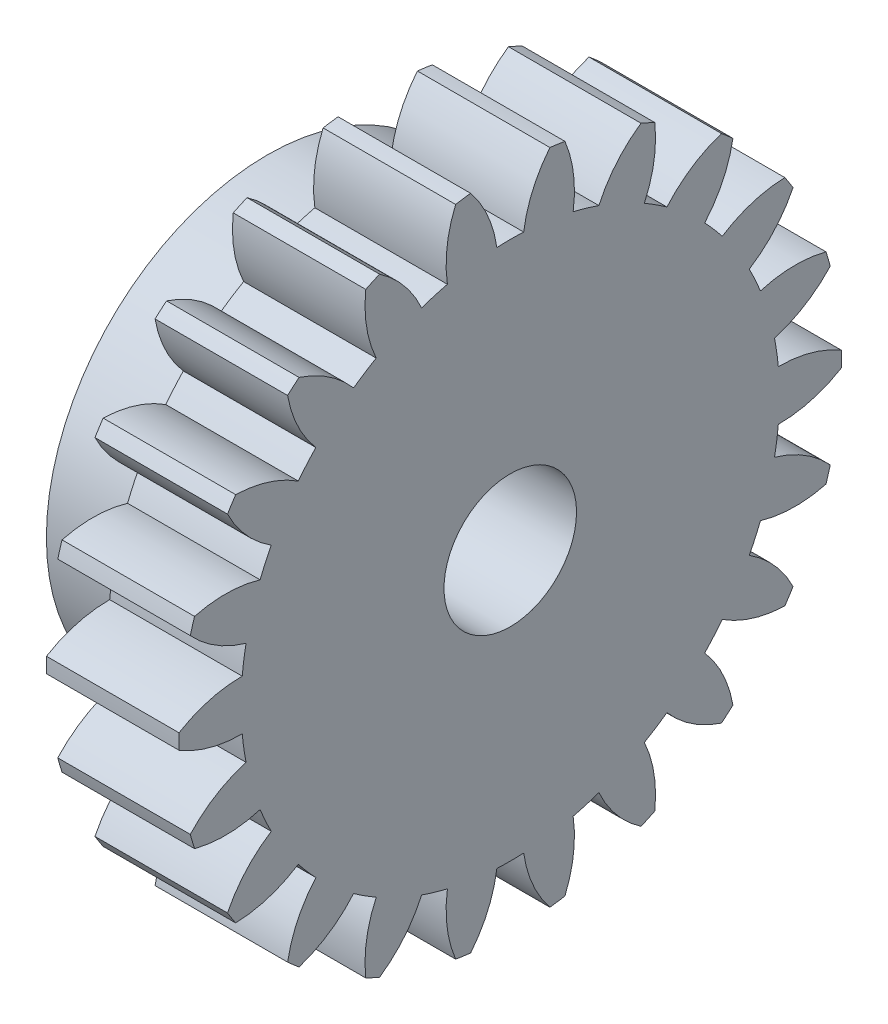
ISO-10303-21;
HEADER;
FILE_DESCRIPTION(('STEP AP214'),'2;1');
FILE_NAME('part.step','',(''),(''),'','','');
FILE_SCHEMA(('AUTOMOTIVE_DESIGN { 1 0 10303 214 1 1 1 1 }'));
ENDSEC;
DATA;
#1=APPLICATION_CONTEXT('core data for automotive mechanical design processes');
#2=APPLICATION_PROTOCOL_DEFINITION('international standard','automotive_design',2000,#1);
#3=PRODUCT_CONTEXT('',#1,'mechanical');
#4=PRODUCT('Part','Part','',(#3));
#5=PRODUCT_RELATED_PRODUCT_CATEGORY('part','',(#4));
#6=PRODUCT_DEFINITION_FORMATION('','',#4);
#7=PRODUCT_DEFINITION_CONTEXT('part definition',#1,'design');
#8=PRODUCT_DEFINITION('design','',#6,#7);
#9=PRODUCT_DEFINITION_SHAPE('','',#8);
#10=(LENGTH_UNIT() NAMED_UNIT(*) SI_UNIT(.MILLI.,.METRE.));
#11=(NAMED_UNIT(*) PLANE_ANGLE_UNIT() SI_UNIT($,.RADIAN.));
#12=(NAMED_UNIT(*) SI_UNIT($,.STERADIAN.) SOLID_ANGLE_UNIT());
#13=UNCERTAINTY_MEASURE_WITH_UNIT(LENGTH_MEASURE(1.E-05),#10,'distance_accuracy_value','');
#14=(GEOMETRIC_REPRESENTATION_CONTEXT(3) GLOBAL_UNCERTAINTY_ASSIGNED_CONTEXT((#13)) GLOBAL_UNIT_ASSIGNED_CONTEXT((#10,
#11,#12)) REPRESENTATION_CONTEXT('',''));
#15=CARTESIAN_POINT('',(0.,0.,0.));
#16=DIRECTION('',(0.,0.,1.));
#17=DIRECTION('',(1.,0.,0.));
#18=AXIS2_PLACEMENT_3D('',#15,#16,#17);
#19=CARTESIAN_POINT('',(12.,0.,0.));
#20=DIRECTION('',(-1.,0.,0.));
#21=DIRECTION('',(0.,0.,1.));
#22=AXIS2_PLACEMENT_3D('',#19,#20,#21);
#23=CYLINDRICAL_SURFACE('',#22,30.);
#24=DIRECTION('',(1.,0.,0.));
#25=VECTOR('',#24,1.);
#26=CARTESIAN_POINT('',(6.,-0.686010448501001,29.992155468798));
#27=LINE('',#26,#25);
#28=CARTESIAN_POINT('',(12.,-0.686010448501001,29.992155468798));
#29=VERTEX_POINT('',#28);
#30=CARTESIAN_POINT('',(0.,-0.686010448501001,29.992155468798));
#31=VERTEX_POINT('',#30);
#32=EDGE_CURVE('E1051',#29,#31,#27,.F.);
#33=ORIENTED_EDGE('',*,*,#32,.F.);
#34=CARTESIAN_POINT('',(12.,0.,0.));
#35=DIRECTION('',(1.,0.,0.));
#36=DIRECTION('',(0.,0.,-1.));
#37=AXIS2_PLACEMENT_3D('',#34,#35,#36);
#38=CIRCLE('',#37,30.);
#39=CARTESIAN_POINT('',(12.,0.686010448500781,29.992155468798));
#40=VERTEX_POINT('',#39);
#41=EDGE_CURVE('E1170',#40,#29,#38,.T.);
#42=ORIENTED_EDGE('',*,*,#41,.F.);
#43=DIRECTION('',(1.,0.,0.));
#44=VECTOR('',#43,1.);
#45=CARTESIAN_POINT('',(6.,0.686010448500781,29.992155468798));
#46=LINE('',#45,#44);
#47=CARTESIAN_POINT('',(0.,0.686010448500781,29.992155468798));
#48=VERTEX_POINT('',#47);
#49=EDGE_CURVE('E1045',#48,#40,#46,.T.);
#50=ORIENTED_EDGE('',*,*,#49,.F.);
#51=CARTESIAN_POINT('',(0.,0.,0.));
#52=DIRECTION('',(1.,0.,0.));
#53=DIRECTION('',(0.,0.,-1.));
#54=AXIS2_PLACEMENT_3D('',#51,#52,#53);
#55=CIRCLE('',#54,30.);
#56=EDGE_CURVE('E1313',#48,#31,#55,.T.);
#57=ORIENTED_EDGE('',*,*,#56,.T.);
#58=EDGE_LOOP('',(#33,#42,#50,#57));
#59=FACE_BOUND('',#58,.T.);
#60=ADVANCED_FACE('F32',(#59),#23,.T.);
#61=DIRECTION('',(1.,0.,0.));
#62=VECTOR('',#61,1.);
#63=CARTESIAN_POINT('',(6.,-7.7915444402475,28.9705339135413));
#64=LINE('',#63,#62);
#65=CARTESIAN_POINT('',(0.,-7.7915444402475,28.9705339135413));
#66=VERTEX_POINT('',#65);
#67=CARTESIAN_POINT('',(12.,-7.7915444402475,28.9705339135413));
#68=VERTEX_POINT('',#67);
#69=EDGE_CURVE('E1049',#66,#68,#64,.T.);
#70=ORIENTED_EDGE('',*,*,#69,.F.);
#71=CARTESIAN_POINT('',(0.,-9.10798885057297,28.5839909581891));
#72=VERTEX_POINT('',#71);
#73=EDGE_CURVE('E1160',#66,#72,#55,.T.);
#74=ORIENTED_EDGE('',*,*,#73,.T.);
#75=DIRECTION('',(1.,0.,0.));
#76=VECTOR('',#75,1.);
#77=CARTESIAN_POINT('',(6.,-9.10798885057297,28.5839909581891));
#78=LINE('',#77,#76);
#79=CARTESIAN_POINT('',(12.,-9.10798885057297,28.5839909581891));
#80=VERTEX_POINT('',#79);
#81=EDGE_CURVE('E1020',#80,#72,#78,.F.);
#82=ORIENTED_EDGE('',*,*,#81,.F.);
#83=EDGE_CURVE('E1168',#68,#80,#38,.T.);
#84=ORIENTED_EDGE('',*,*,#83,.F.);
#85=EDGE_LOOP('',(#70,#74,#82,#84));
#86=FACE_BOUND('',#85,.T.);
#87=ADVANCED_FACE('F1165',(#86),#23,.T.);
#88=DIRECTION('',(1.,0.,0.));
#89=VECTOR('',#88,1.);
#90=CARTESIAN_POINT('',(6.,7.79154444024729,28.9705339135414));
#91=LINE('',#90,#89);
#92=CARTESIAN_POINT('',(12.,7.79154444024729,28.9705339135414));
#93=VERTEX_POINT('',#92);
#94=CARTESIAN_POINT('',(0.,7.79154444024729,28.9705339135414));
#95=VERTEX_POINT('',#94);
#96=EDGE_CURVE('E1047',#93,#95,#91,.F.);
#97=ORIENTED_EDGE('',*,*,#96,.F.);
#98=CARTESIAN_POINT('',(12.,9.10798885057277,28.5839909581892));
#99=VERTEX_POINT('',#98);
#100=EDGE_CURVE('E1173',#99,#93,#38,.T.);
#101=ORIENTED_EDGE('',*,*,#100,.F.);
#102=DIRECTION('',(1.,0.,0.));
#103=VECTOR('',#102,1.);
#104=CARTESIAN_POINT('',(6.,9.10798885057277,28.5839909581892));
#105=LINE('',#104,#103);
#106=CARTESIAN_POINT('',(0.,9.10798885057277,28.5839909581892));
#107=VERTEX_POINT('',#106);
#108=EDGE_CURVE('E1042',#107,#99,#105,.T.);
#109=ORIENTED_EDGE('',*,*,#108,.F.);
#110=EDGE_CURVE('E1314',#107,#95,#55,.T.);
#111=ORIENTED_EDGE('',*,*,#110,.T.);
#112=EDGE_LOOP('',(#97,#101,#109,#111));
#113=FACE_BOUND('',#112,.T.);
#114=ADVANCED_FACE('F1359',(#113),#23,.T.);
#115=DIRECTION('',(1.,0.,0.));
#116=VECTOR('',#115,1.);
#117=CARTESIAN_POINT('',(6.,15.6378747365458,25.601891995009));
#118=LINE('',#117,#116);
#119=CARTESIAN_POINT('',(12.,15.6378747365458,25.601891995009));
#120=VERTEX_POINT('',#119);
#121=CARTESIAN_POINT('',(0.,15.6378747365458,25.601891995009));
#122=VERTEX_POINT('',#121);
#123=EDGE_CURVE('E583',#120,#122,#118,.F.);
#124=ORIENTED_EDGE('',*,*,#123,.F.);
#125=CARTESIAN_POINT('',(12.,16.7920921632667,24.8601214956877));
#126=VERTEX_POINT('',#125);
#127=EDGE_CURVE('E1353',#126,#120,#38,.T.);
#128=ORIENTED_EDGE('',*,*,#127,.F.);
#129=DIRECTION('',(1.,0.,0.));
#130=VECTOR('',#129,1.);
#131=CARTESIAN_POINT('',(6.,16.7920921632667,24.8601214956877));
#132=LINE('',#131,#130);
#133=CARTESIAN_POINT('',(0.,16.7920921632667,24.8601214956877));
#134=VERTEX_POINT('',#133);
#135=EDGE_CURVE('E1034',#134,#126,#132,.T.);
#136=ORIENTED_EDGE('',*,*,#135,.F.);
#137=EDGE_CURVE('E1318',#134,#122,#55,.T.);
#138=ORIENTED_EDGE('',*,*,#137,.T.);
#139=EDGE_LOOP('',(#124,#128,#136,#138));
#140=FACE_BOUND('',#139,.T.);
#141=ADVANCED_FACE('F2193',(#140),#23,.T.);
#142=DIRECTION('',(1.,0.,0.));
#143=VECTOR('',#142,1.);
#144=CARTESIAN_POINT('',(6.,26.9968451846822,13.0832087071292));
#145=LINE('',#144,#143);
#146=CARTESIAN_POINT('',(12.,26.9968451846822,13.0832087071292));
#147=VERTEX_POINT('',#146);
#148=CARTESIAN_POINT('',(0.,26.9968451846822,13.0832087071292));
#149=VERTEX_POINT('',#148);
#150=EDGE_CURVE('E1040',#147,#149,#145,.F.);
#151=ORIENTED_EDGE('',*,*,#150,.F.);
#152=CARTESIAN_POINT('',(12.,27.566803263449,11.8351746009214));
#153=VERTEX_POINT('',#152);
#154=EDGE_CURVE('E1105',#153,#147,#38,.T.);
#155=ORIENTED_EDGE('',*,*,#154,.F.);
#156=DIRECTION('',(1.,0.,0.));
#157=VECTOR('',#156,1.);
#158=CARTESIAN_POINT('',(6.,27.566803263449,11.8351746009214));
#159=LINE('',#158,#157);
#160=CARTESIAN_POINT('',(0.,27.566803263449,11.8351746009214));
#161=VERTEX_POINT('',#160);
#162=EDGE_CURVE('E1072',#161,#153,#159,.T.);
#163=ORIENTED_EDGE('',*,*,#162,.F.);
#164=EDGE_CURVE('E1110',#161,#149,#55,.T.);
#165=ORIENTED_EDGE('',*,*,#164,.T.);
#166=EDGE_LOOP('',(#151,#155,#163,#165));
#167=FACE_BOUND('',#166,.T.);
#168=ADVANCED_FACE('F1335',(#167),#23,.T.);
#169=DIRECTION('',(1.,0.,0.));
#170=VECTOR('',#169,1.);
#171=CARTESIAN_POINT('',(6.,23.1158000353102,19.122232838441));
#172=LINE('',#171,#170);
#173=CARTESIAN_POINT('',(0.,23.1158000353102,19.122232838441));
#174=VERTEX_POINT('',#173);
#175=CARTESIAN_POINT('',(12.,23.1158000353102,19.122232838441));
#176=VERTEX_POINT('',#175);
#177=EDGE_CURVE('E1038',#174,#176,#172,.T.);
#178=ORIENTED_EDGE('',*,*,#177,.F.);
#179=CARTESIAN_POINT('',(0.,22.2173174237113,20.1591370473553));
#180=VERTEX_POINT('',#179);
#181=EDGE_CURVE('E1322',#174,#180,#55,.T.);
#182=ORIENTED_EDGE('',*,*,#181,.T.);
#183=DIRECTION('',(1.,0.,0.));
#184=VECTOR('',#183,1.);
#185=CARTESIAN_POINT('',(6.,22.2173174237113,20.1591370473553));
#186=LINE('',#185,#184);
#187=CARTESIAN_POINT('',(12.,22.2173174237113,20.1591370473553));
#188=VERTEX_POINT('',#187);
#189=EDGE_CURVE('E1036',#188,#180,#186,.F.);
#190=ORIENTED_EDGE('',*,*,#189,.F.);
#191=EDGE_CURVE('E1352',#176,#188,#38,.T.);
#192=ORIENTED_EDGE('',*,*,#191,.F.);
#193=EDGE_LOOP('',(#178,#182,#190,#192));
#194=FACE_BOUND('',#193,.T.);
#195=ADVANCED_FACE('F2180',(#194),#23,.T.);
#196=DIRECTION('',(1.,0.,0.));
#197=VECTOR('',#196,1.);
#198=CARTESIAN_POINT('',(6.,-29.7845080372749,3.58930090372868));
#199=LINE('',#198,#197);
#200=CARTESIAN_POINT('',(12.,-29.7845080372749,3.58930090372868));
#201=VERTEX_POINT('',#200);
#202=CARTESIAN_POINT('',(0.,-29.7845080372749,3.58930090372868));
#203=VERTEX_POINT('',#202);
#204=EDGE_CURVE('E1032',#201,#203,#199,.F.);
#205=ORIENTED_EDGE('',*,*,#204,.F.);
#206=CARTESIAN_POINT('',(12.,-29.5892491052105,4.94735660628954));
#207=VERTEX_POINT('',#206);
#208=EDGE_CURVE('E1181',#207,#201,#38,.T.);
#209=ORIENTED_EDGE('',*,*,#208,.F.);
#210=DIRECTION('',(1.,0.,0.));
#211=VECTOR('',#210,1.);
#212=CARTESIAN_POINT('',(6.,-29.5892491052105,4.94735660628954));
#213=LINE('',#212,#211);
#214=CARTESIAN_POINT('',(0.,-29.5892491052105,4.94735660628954));
#215=VERTEX_POINT('',#214);
#216=EDGE_CURVE('E1026',#215,#207,#213,.T.);
#217=ORIENTED_EDGE('',*,*,#216,.F.);
#218=EDGE_CURVE('E1285',#215,#203,#55,.T.);
#219=ORIENTED_EDGE('',*,*,#218,.T.);
#220=EDGE_LOOP('',(#205,#209,#217,#219));
#221=FACE_BOUND('',#220,.T.);
#222=ADVANCED_FACE('F2173',(#221),#23,.T.);
#223=DIRECTION('',(1.,0.,0.));
#224=VECTOR('',#223,1.);
#225=CARTESIAN_POINT('',(6.,-29.7845080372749,-3.58930090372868));
#226=LINE('',#225,#224);
#227=CARTESIAN_POINT('',(0.,-29.7845080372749,-3.58930090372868));
#228=VERTEX_POINT('',#227);
#229=CARTESIAN_POINT('',(12.,-29.7845080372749,-3.58930090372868));
#230=VERTEX_POINT('',#229);
#231=EDGE_CURVE('E1030',#228,#230,#226,.T.);
#232=ORIENTED_EDGE('',*,*,#231,.F.);
#233=CARTESIAN_POINT('',(0.,-29.5892491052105,-4.94735660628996));
#234=VERTEX_POINT('',#233);
#235=EDGE_CURVE('E1279',#228,#234,#55,.T.);
#236=ORIENTED_EDGE('',*,*,#235,.T.);
#237=DIRECTION('',(1.,0.,0.));
#238=VECTOR('',#237,1.);
#239=CARTESIAN_POINT('',(6.,-29.5892491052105,-4.94735660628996));
#240=LINE('',#239,#238);
#241=CARTESIAN_POINT('',(12.,-29.5892491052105,-4.94735660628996));
#242=VERTEX_POINT('',#241);
#243=EDGE_CURVE('E996',#242,#234,#240,.F.);
#244=ORIENTED_EDGE('',*,*,#243,.F.);
#245=EDGE_CURVE('E1184',#230,#242,#38,.T.);
#246=ORIENTED_EDGE('',*,*,#245,.F.);
#247=EDGE_LOOP('',(#232,#236,#244,#246));
#248=FACE_BOUND('',#247,.T.);
#249=ADVANCED_FACE('F2166',(#248),#23,.T.);
#250=DIRECTION('',(1.,0.,0.));
#251=VECTOR('',#250,1.);
#252=CARTESIAN_POINT('',(6.,-27.5668032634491,11.8351746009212));
#253=LINE('',#252,#251);
#254=CARTESIAN_POINT('',(12.,-27.5668032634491,11.8351746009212));
#255=VERTEX_POINT('',#254);
#256=CARTESIAN_POINT('',(0.,-27.5668032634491,11.8351746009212));
#257=VERTEX_POINT('',#256);
#258=EDGE_CURVE('E1028',#255,#257,#253,.F.);
#259=ORIENTED_EDGE('',*,*,#258,.F.);
#260=CARTESIAN_POINT('',(12.,-26.9968451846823,13.083208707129));
#261=VERTEX_POINT('',#260);
#262=EDGE_CURVE('E1178',#261,#255,#38,.T.);
#263=ORIENTED_EDGE('',*,*,#262,.F.);
#264=DIRECTION('',(1.,0.,0.));
#265=VECTOR('',#264,1.);
#266=CARTESIAN_POINT('',(6.,-26.9968451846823,13.083208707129));
#267=LINE('',#266,#265);
#268=CARTESIAN_POINT('',(0.,-26.9968451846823,13.083208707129));
#269=VERTEX_POINT('',#268);
#270=EDGE_CURVE('E1022',#269,#261,#267,.T.);
#271=ORIENTED_EDGE('',*,*,#270,.F.);
#272=EDGE_CURVE('E1291',#269,#257,#55,.T.);
#273=ORIENTED_EDGE('',*,*,#272,.T.);
#274=EDGE_LOOP('',(#259,#263,#271,#273));
#275=FACE_BOUND('',#274,.T.);
#276=ADVANCED_FACE('F2159',(#275),#23,.T.);
#277=DIRECTION('',(1.,0.,0.));
#278=VECTOR('',#277,1.);
#279=CARTESIAN_POINT('',(6.,-23.1158000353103,19.1222328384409));
#280=LINE('',#279,#278);
#281=CARTESIAN_POINT('',(12.,-23.1158000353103,19.1222328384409));
#282=VERTEX_POINT('',#281);
#283=CARTESIAN_POINT('',(0.,-23.1158000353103,19.1222328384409));
#284=VERTEX_POINT('',#283);
#285=EDGE_CURVE('E1024',#282,#284,#280,.F.);
#286=ORIENTED_EDGE('',*,*,#285,.F.);
#287=CARTESIAN_POINT('',(12.,-22.2173174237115,20.1591370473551));
#288=VERTEX_POINT('',#287);
#289=EDGE_CURVE('E1175',#288,#282,#38,.T.);
#290=ORIENTED_EDGE('',*,*,#289,.F.);
#291=DIRECTION('',(1.,0.,0.));
#292=VECTOR('',#291,1.);
#293=CARTESIAN_POINT('',(6.,-22.2173174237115,20.1591370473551));
#294=LINE('',#293,#292);
#295=CARTESIAN_POINT('',(0.,-22.2173174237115,20.1591370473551));
#296=VERTEX_POINT('',#295);
#297=EDGE_CURVE('E1014',#296,#288,#294,.T.);
#298=ORIENTED_EDGE('',*,*,#297,.F.);
#299=EDGE_CURVE('E1297',#296,#284,#55,.T.);
#300=ORIENTED_EDGE('',*,*,#299,.T.);
#301=EDGE_LOOP('',(#286,#290,#298,#300));
#302=FACE_BOUND('',#301,.T.);
#303=ADVANCED_FACE('F2152',(#302),#23,.T.);
#304=DIRECTION('',(1.,0.,0.));
#305=VECTOR('',#304,1.);
#306=CARTESIAN_POINT('',(6.,-15.6378747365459,25.6018919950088));
#307=LINE('',#306,#305);
#308=CARTESIAN_POINT('',(0.,-15.6378747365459,25.6018919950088));
#309=VERTEX_POINT('',#308);
#310=CARTESIAN_POINT('',(12.,-15.6378747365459,25.6018919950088));
#311=VERTEX_POINT('',#310);
#312=EDGE_CURVE('E1018',#309,#311,#307,.T.);
#313=ORIENTED_EDGE('',*,*,#312,.F.);
#314=CARTESIAN_POINT('',(0.,-16.7920921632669,24.8601214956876));
#315=VERTEX_POINT('',#314);
#316=EDGE_CURVE('E1303',#309,#315,#55,.T.);
#317=ORIENTED_EDGE('',*,*,#316,.T.);
#318=DIRECTION('',(1.,0.,0.));
#319=VECTOR('',#318,1.);
#320=CARTESIAN_POINT('',(6.,-16.7920921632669,24.8601214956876));
#321=LINE('',#320,#319);
#322=CARTESIAN_POINT('',(12.,-16.7920921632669,24.8601214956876));
#323=VERTEX_POINT('',#322);
#324=EDGE_CURVE('E1016',#323,#315,#321,.F.);
#325=ORIENTED_EDGE('',*,*,#324,.F.);
#326=EDGE_CURVE('E1171',#311,#323,#38,.T.);
#327=ORIENTED_EDGE('',*,*,#326,.F.);
#328=EDGE_LOOP('',(#313,#317,#325,#327));
#329=FACE_BOUND('',#328,.T.);
#330=ADVANCED_FACE('F2145',(#329),#23,.T.);
#331=DIRECTION('',(1.,0.,0.));
#332=VECTOR('',#331,1.);
#333=CARTESIAN_POINT('',(6.,-22.2173174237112,-20.1591370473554));
#334=LINE('',#333,#332);
#335=CARTESIAN_POINT('',(12.,-22.2173174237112,-20.1591370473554));
#336=VERTEX_POINT('',#335);
#337=CARTESIAN_POINT('',(0.,-22.2173174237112,-20.1591370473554));
#338=VERTEX_POINT('',#337);
#339=EDGE_CURVE('E1012',#336,#338,#334,.F.);
#340=ORIENTED_EDGE('',*,*,#339,.F.);
#341=CARTESIAN_POINT('',(12.,-23.1158000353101,-19.1222328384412));
#342=VERTEX_POINT('',#341);
#343=EDGE_CURVE('E1190',#342,#336,#38,.T.);
#344=ORIENTED_EDGE('',*,*,#343,.F.);
#345=DIRECTION('',(1.,0.,0.));
#346=VECTOR('',#345,1.);
#347=CARTESIAN_POINT('',(6.,-23.1158000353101,-19.1222328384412));
#348=LINE('',#347,#346);
#349=CARTESIAN_POINT('',(0.,-23.1158000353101,-19.1222328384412));
#350=VERTEX_POINT('',#349);
#351=EDGE_CURVE('E998',#350,#342,#348,.T.);
#352=ORIENTED_EDGE('',*,*,#351,.F.);
#353=EDGE_CURVE('E1267',#350,#338,#55,.T.);
#354=ORIENTED_EDGE('',*,*,#353,.T.);
#355=EDGE_LOOP('',(#340,#344,#352,#354));
#356=FACE_BOUND('',#355,.T.);
#357=ADVANCED_FACE('F2138',(#356),#23,.T.);
#358=DIRECTION('',(1.,0.,0.));
#359=VECTOR('',#358,1.);
#360=CARTESIAN_POINT('',(6.,-16.7920921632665,-24.8601214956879));
#361=LINE('',#360,#359);
#362=CARTESIAN_POINT('',(0.,-16.7920921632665,-24.8601214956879));
#363=VERTEX_POINT('',#362);
#364=CARTESIAN_POINT('',(12.,-16.7920921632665,-24.8601214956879));
#365=VERTEX_POINT('',#364);
#366=EDGE_CURVE('E1010',#363,#365,#361,.T.);
#367=ORIENTED_EDGE('',*,*,#366,.F.);
#368=CARTESIAN_POINT('',(0.,-15.6378747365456,-25.6018919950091));
#369=VERTEX_POINT('',#368);
#370=EDGE_CURVE('E1261',#363,#369,#55,.T.);
#371=ORIENTED_EDGE('',*,*,#370,.T.);
#372=DIRECTION('',(1.,0.,0.));
#373=VECTOR('',#372,1.);
#374=CARTESIAN_POINT('',(6.,-15.6378747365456,-25.6018919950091));
#375=LINE('',#374,#373);
#376=CARTESIAN_POINT('',(12.,-15.6378747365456,-25.6018919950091));
#377=VERTEX_POINT('',#376);
#378=EDGE_CURVE('E1008',#377,#369,#375,.F.);
#379=ORIENTED_EDGE('',*,*,#378,.F.);
#380=EDGE_CURVE('E1193',#365,#377,#38,.T.);
#381=ORIENTED_EDGE('',*,*,#380,.F.);
#382=EDGE_LOOP('',(#367,#371,#379,#381));
#383=FACE_BOUND('',#382,.T.);
#384=ADVANCED_FACE('F2131',(#383),#23,.T.);
#385=DIRECTION('',(1.,0.,0.));
#386=VECTOR('',#385,1.);
#387=CARTESIAN_POINT('',(6.,-9.10798885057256,-28.5839909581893));
#388=LINE('',#387,#386);
#389=CARTESIAN_POINT('',(0.,-9.10798885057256,-28.5839909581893));
#390=VERTEX_POINT('',#389);
#391=CARTESIAN_POINT('',(12.,-9.10798885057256,-28.5839909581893));
#392=VERTEX_POINT('',#391);
#393=EDGE_CURVE('E1006',#390,#392,#388,.T.);
#394=ORIENTED_EDGE('',*,*,#393,.F.);
#395=CARTESIAN_POINT('',(0.,-7.79154444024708,-28.9705339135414));
#396=VERTEX_POINT('',#395);
#397=EDGE_CURVE('E1255',#390,#396,#55,.T.);
#398=ORIENTED_EDGE('',*,*,#397,.T.);
#399=DIRECTION('',(1.,0.,0.));
#400=VECTOR('',#399,1.);
#401=CARTESIAN_POINT('',(6.,-7.79154444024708,-28.9705339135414));
#402=LINE('',#401,#400);
#403=CARTESIAN_POINT('',(12.,-7.79154444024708,-28.9705339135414));
#404=VERTEX_POINT('',#403);
#405=EDGE_CURVE('E1004',#404,#396,#402,.F.);
#406=ORIENTED_EDGE('',*,*,#405,.F.);
#407=EDGE_CURVE('E1196',#392,#404,#38,.T.);
#408=ORIENTED_EDGE('',*,*,#407,.F.);
#409=EDGE_LOOP('',(#394,#398,#406,#408));
#410=FACE_BOUND('',#409,.T.);
#411=ADVANCED_FACE('F2124',(#410),#23,.T.);
#412=DIRECTION('',(1.,0.,0.));
#413=VECTOR('',#412,1.);
#414=CARTESIAN_POINT('',(6.,-0.686010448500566,-29.992155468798));
#415=LINE('',#414,#413);
#416=CARTESIAN_POINT('',(0.,-0.686010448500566,-29.992155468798));
#417=VERTEX_POINT('',#416);
#418=CARTESIAN_POINT('',(12.,-0.686010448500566,-29.992155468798));
#419=VERTEX_POINT('',#418);
#420=EDGE_CURVE('E1002',#417,#419,#415,.T.);
#421=ORIENTED_EDGE('',*,*,#420,.F.);
#422=CARTESIAN_POINT('',(0.,0.686010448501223,-29.992155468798));
#423=VERTEX_POINT('',#422);
#424=EDGE_CURVE('E1249',#417,#423,#55,.T.);
#425=ORIENTED_EDGE('',*,*,#424,.T.);
#426=DIRECTION('',(1.,0.,0.));
#427=VECTOR('',#426,1.);
#428=CARTESIAN_POINT('',(6.,0.686010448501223,-29.992155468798));
#429=LINE('',#428,#427);
#430=CARTESIAN_POINT('',(12.,0.686010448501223,-29.992155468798));
#431=VERTEX_POINT('',#430);
#432=EDGE_CURVE('E976',#431,#423,#429,.F.);
#433=ORIENTED_EDGE('',*,*,#432,.F.);
#434=EDGE_CURVE('E1199',#419,#431,#38,.T.);
#435=ORIENTED_EDGE('',*,*,#434,.F.);
#436=EDGE_LOOP('',(#421,#425,#433,#435));
#437=FACE_BOUND('',#436,.T.);
#438=ADVANCED_FACE('F2117',(#437),#23,.T.);
#439=DIRECTION('',(1.,0.,0.));
#440=VECTOR('',#439,1.);
#441=CARTESIAN_POINT('',(6.,-26.9968451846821,-13.0832087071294));
#442=LINE('',#441,#440);
#443=CARTESIAN_POINT('',(12.,-26.9968451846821,-13.0832087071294));
#444=VERTEX_POINT('',#443);
#445=CARTESIAN_POINT('',(0.,-26.9968451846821,-13.0832087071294));
#446=VERTEX_POINT('',#445);
#447=EDGE_CURVE('E1000',#444,#446,#442,.F.);
#448=ORIENTED_EDGE('',*,*,#447,.F.);
#449=CARTESIAN_POINT('',(12.,-27.566803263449,-11.8351746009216));
#450=VERTEX_POINT('',#449);
#451=EDGE_CURVE('E1187',#450,#444,#38,.T.);
#452=ORIENTED_EDGE('',*,*,#451,.F.);
#453=DIRECTION('',(1.,0.,0.));
#454=VECTOR('',#453,1.);
#455=CARTESIAN_POINT('',(6.,-27.566803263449,-11.8351746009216));
#456=LINE('',#455,#454);
#457=CARTESIAN_POINT('',(0.,-27.566803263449,-11.8351746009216));
#458=VERTEX_POINT('',#457);
#459=EDGE_CURVE('E994',#458,#450,#456,.T.);
#460=ORIENTED_EDGE('',*,*,#459,.F.);
#461=EDGE_CURVE('E1273',#458,#446,#55,.T.);
#462=ORIENTED_EDGE('',*,*,#461,.T.);
#463=EDGE_LOOP('',(#448,#452,#460,#462));
#464=FACE_BOUND('',#463,.T.);
#465=ADVANCED_FACE('F2110',(#464),#23,.T.);
#466=DIRECTION('',(1.,0.,0.));
#467=VECTOR('',#466,1.);
#468=CARTESIAN_POINT('',(6.,16.7920921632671,-24.8601214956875));
#469=LINE('',#468,#467);
#470=CARTESIAN_POINT('',(12.,16.7920921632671,-24.8601214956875));
#471=VERTEX_POINT('',#470);
#472=CARTESIAN_POINT('',(0.,16.7920921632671,-24.8601214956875));
#473=VERTEX_POINT('',#472);
#474=EDGE_CURVE('E992',#471,#473,#469,.F.);
#475=ORIENTED_EDGE('',*,*,#474,.F.);
#476=CARTESIAN_POINT('',(12.,15.6378747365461,-25.6018919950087));
#477=VERTEX_POINT('',#476);
#478=EDGE_CURVE('E1205',#477,#471,#38,.T.);
#479=ORIENTED_EDGE('',*,*,#478,.F.);
#480=DIRECTION('',(1.,0.,0.));
#481=VECTOR('',#480,1.);
#482=CARTESIAN_POINT('',(6.,15.6378747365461,-25.6018919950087));
#483=LINE('',#482,#481);
#484=CARTESIAN_POINT('',(0.,15.6378747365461,-25.6018919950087));
#485=VERTEX_POINT('',#484);
#486=EDGE_CURVE('E978',#485,#477,#483,.T.);
#487=ORIENTED_EDGE('',*,*,#486,.F.);
#488=EDGE_CURVE('E1237',#485,#473,#55,.T.);
#489=ORIENTED_EDGE('',*,*,#488,.T.);
#490=EDGE_LOOP('',(#475,#479,#487,#489));
#491=FACE_BOUND('',#490,.T.);
#492=ADVANCED_FACE('F1413',(#491),#23,.T.);
#493=DIRECTION('',(1.,0.,0.));
#494=VECTOR('',#493,1.);
#495=CARTESIAN_POINT('',(6.,22.2173174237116,-20.159137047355));
#496=LINE('',#495,#494);
#497=CARTESIAN_POINT('',(0.,22.2173174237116,-20.159137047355));
#498=VERTEX_POINT('',#497);
#499=CARTESIAN_POINT('',(12.,22.2173174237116,-20.159137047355));
#500=VERTEX_POINT('',#499);
#501=EDGE_CURVE('E990',#498,#500,#496,.T.);
#502=ORIENTED_EDGE('',*,*,#501,.F.);
#503=CARTESIAN_POINT('',(0.,23.1158000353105,-19.1222328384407));
#504=VERTEX_POINT('',#503);
#505=EDGE_CURVE('E1231',#498,#504,#55,.T.);
#506=ORIENTED_EDGE('',*,*,#505,.T.);
#507=DIRECTION('',(1.,0.,0.));
#508=VECTOR('',#507,1.);
#509=CARTESIAN_POINT('',(6.,23.1158000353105,-19.1222328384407));
#510=LINE('',#509,#508);
#511=CARTESIAN_POINT('',(12.,23.1158000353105,-19.1222328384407));
#512=VERTEX_POINT('',#511);
#513=EDGE_CURVE('E988',#512,#504,#510,.F.);
#514=ORIENTED_EDGE('',*,*,#513,.F.);
#515=EDGE_CURVE('E1208',#500,#512,#38,.T.);
#516=ORIENTED_EDGE('',*,*,#515,.F.);
#517=EDGE_LOOP('',(#502,#506,#514,#516));
#518=FACE_BOUND('',#517,.T.);
#519=ADVANCED_FACE('F1424',(#518),#23,.T.);
#520=DIRECTION('',(1.,0.,0.));
#521=VECTOR('',#520,1.);
#522=CARTESIAN_POINT('',(6.,26.9968451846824,-13.0832087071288));
#523=LINE('',#522,#521);
#524=CARTESIAN_POINT('',(0.,26.9968451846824,-13.0832087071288));
#525=VERTEX_POINT('',#524);
#526=CARTESIAN_POINT('',(12.,26.9968451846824,-13.0832087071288));
#527=VERTEX_POINT('',#526);
#528=EDGE_CURVE('E986',#525,#527,#523,.T.);
#529=ORIENTED_EDGE('',*,*,#528,.F.);
#530=CARTESIAN_POINT('',(0.,27.5668032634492,-11.835174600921));
#531=VERTEX_POINT('',#530);
#532=EDGE_CURVE('E1229',#525,#531,#55,.T.);
#533=ORIENTED_EDGE('',*,*,#532,.T.);
#534=DIRECTION('',(1.,0.,0.));
#535=VECTOR('',#534,1.);
#536=CARTESIAN_POINT('',(6.,27.5668032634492,-11.835174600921));
#537=LINE('',#536,#535);
#538=CARTESIAN_POINT('',(12.,27.5668032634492,-11.835174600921));
#539=VERTEX_POINT('',#538);
#540=EDGE_CURVE('E984',#539,#531,#537,.F.);
#541=ORIENTED_EDGE('',*,*,#540,.F.);
#542=EDGE_CURVE('E1211',#527,#539,#38,.T.);
#543=ORIENTED_EDGE('',*,*,#542,.F.);
#544=EDGE_LOOP('',(#529,#533,#541,#543));
#545=FACE_BOUND('',#544,.T.);
#546=ADVANCED_FACE('F1401',(#545),#23,.T.);
#547=DIRECTION('',(1.,0.,0.));
#548=VECTOR('',#547,1.);
#549=CARTESIAN_POINT('',(6.,29.5892491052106,-4.94735660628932));
#550=LINE('',#549,#548);
#551=CARTESIAN_POINT('',(0.,29.5892491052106,-4.94735660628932));
#552=VERTEX_POINT('',#551);
#553=CARTESIAN_POINT('',(12.,29.5892491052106,-4.94735660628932));
#554=VERTEX_POINT('',#553);
#555=EDGE_CURVE('E982',#552,#554,#550,.T.);
#556=ORIENTED_EDGE('',*,*,#555,.F.);
#557=CARTESIAN_POINT('',(0.,29.7845080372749,-3.58930090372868));
#558=VERTEX_POINT('',#557);
#559=EDGE_CURVE('E1100',#552,#558,#55,.T.);
#560=ORIENTED_EDGE('',*,*,#559,.T.);
#561=DIRECTION('',(1.,0.,0.));
#562=VECTOR('',#561,1.);
#563=CARTESIAN_POINT('',(6.,29.7845080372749,-3.58930090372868));
#564=LINE('',#563,#562);
#565=CARTESIAN_POINT('',(12.,29.7845080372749,-3.58930090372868));
#566=VERTEX_POINT('',#565);
#567=EDGE_CURVE('E1097',#566,#558,#564,.F.);
#568=ORIENTED_EDGE('',*,*,#567,.F.);
#569=EDGE_CURVE('E1106',#554,#566,#38,.T.);
#570=ORIENTED_EDGE('',*,*,#569,.F.);
#571=EDGE_LOOP('',(#556,#560,#568,#570));
#572=FACE_BOUND('',#571,.T.);
#573=ADVANCED_FACE('F1226',(#572),#23,.T.);
#574=DIRECTION('',(1.,0.,0.));
#575=VECTOR('',#574,1.);
#576=CARTESIAN_POINT('',(6.,9.10798885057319,-28.5839909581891));
#577=LINE('',#576,#575);
#578=CARTESIAN_POINT('',(12.,9.10798885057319,-28.5839909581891));
#579=VERTEX_POINT('',#578);
#580=CARTESIAN_POINT('',(0.,9.10798885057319,-28.5839909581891));
#581=VERTEX_POINT('',#580);
#582=EDGE_CURVE('E980',#579,#581,#577,.F.);
#583=ORIENTED_EDGE('',*,*,#582,.F.);
#584=CARTESIAN_POINT('',(12.,7.79154444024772,-28.9705339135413));
#585=VERTEX_POINT('',#584);
#586=EDGE_CURVE('E1202',#585,#579,#38,.T.);
#587=ORIENTED_EDGE('',*,*,#586,.F.);
#588=DIRECTION('',(1.,0.,0.));
#589=VECTOR('',#588,1.);
#590=CARTESIAN_POINT('',(6.,7.79154444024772,-28.9705339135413));
#591=LINE('',#590,#589);
#592=CARTESIAN_POINT('',(0.,7.79154444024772,-28.9705339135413));
#593=VERTEX_POINT('',#592);
#594=EDGE_CURVE('E690',#593,#585,#591,.T.);
#595=ORIENTED_EDGE('',*,*,#594,.F.);
#596=EDGE_CURVE('E1243',#593,#581,#55,.T.);
#597=ORIENTED_EDGE('',*,*,#596,.T.);
#598=EDGE_LOOP('',(#583,#587,#595,#597));
#599=FACE_BOUND('',#598,.T.);
#600=ADVANCED_FACE('F1385',(#599),#23,.T.);
#601=CARTESIAN_POINT('',(12.,0.,0.));
#602=DIRECTION('',(1.,0.,0.));
#603=DIRECTION('',(0.,0.,-1.));
#604=AXIS2_PLACEMENT_3D('',#601,#602,#603);
#605=PLANE('',#604);
#606=CARTESIAN_POINT('',(12.,0.,0.));
#607=DIRECTION('',(1.,0.,0.));
#608=DIRECTION('',(0.,0.,-1.));
#609=AXIS2_PLACEMENT_3D('',#606,#607,#608);
#610=CIRCLE('',#609,6.);
#611=CARTESIAN_POINT('',(12.,0.,-6.));
#612=VERTEX_POINT('',#611);
#613=EDGE_CURVE('E2077',#612,#612,#610,.T.);
#614=ORIENTED_EDGE('',*,*,#613,.F.);
#615=EDGE_LOOP('',(#614));
#616=FACE_BOUND('',#615,.T.);
#617=ORIENTED_EDGE('',*,*,#41,.T.);
#618=CARTESIAN_POINT('',(12.,8.73834029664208,24.3192714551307));
#619=DIRECTION('',(1.,0.,0.));
#620=DIRECTION('',(0.,0.989821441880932,0.142314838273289));
#621=AXIS2_PLACEMENT_3D('',#618,#619,#620);
#622=CIRCLE('',#621,11.);
#623=CARTESIAN_POINT('',(12.,-2.26154416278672,24.2688544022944));
#624=VERTEX_POINT('',#623);
#625=EDGE_CURVE('E641',#29,#624,#622,.T.);
#626=ORIENTED_EDGE('',*,*,#625,.T.);
#627=CARTESIAN_POINT('',(12.,0.,0.));
#628=DIRECTION('',(1.,0.,0.));
#629=DIRECTION('',(0.,0.989821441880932,0.142314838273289));
#630=AXIS2_PLACEMENT_3D('',#627,#628,#629);
#631=CIRCLE('',#630,24.374);
#632=CARTESIAN_POINT('',(12.,-4.66739066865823,23.9229458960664));
#633=VERTEX_POINT('',#632);
#634=EDGE_CURVE('E644',#624,#633,#631,.T.);
#635=ORIENTED_EDGE('',*,*,#634,.T.);
#636=CARTESIAN_POINT('',(12.,-15.2359066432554,20.872295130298));
#637=DIRECTION('',(1.,0.,0.));
#638=DIRECTION('',(0.,0.989821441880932,0.142314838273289));
#639=AXIS2_PLACEMENT_3D('',#636,#637,#638);
#640=CIRCLE('',#639,11.);
#641=EDGE_CURVE('E639',#633,#68,#640,.T.);
#642=ORIENTED_EDGE('',*,*,#641,.T.);
#643=ORIENTED_EDGE('',*,*,#83,.T.);
#644=CARTESIAN_POINT('',(12.,1.5328455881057,25.796045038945));
#645=DIRECTION('',(1.,0.,0.));
#646=DIRECTION('',(0.,0.909631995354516,0.415415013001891));
#647=AXIS2_PLACEMENT_3D('',#644,#645,#646);
#648=CIRCLE('',#647,11.);
#649=CARTESIAN_POINT('',(12.,-9.00726213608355,22.648644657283));
#650=VERTEX_POINT('',#649);
#651=EDGE_CURVE('E768',#80,#650,#648,.T.);
#652=ORIENTED_EDGE('',*,*,#651,.T.);
#653=CARTESIAN_POINT('',(12.,0.,0.));
#654=DIRECTION('',(1.,0.,0.));
#655=DIRECTION('',(0.,0.909631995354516,0.415415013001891));
#656=AXIS2_PLACEMENT_3D('',#653,#654,#655);
#657=CIRCLE('',#656,24.374);
#658=CARTESIAN_POINT('',(12.,-11.2182012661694,21.6389425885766));
#659=VERTEX_POINT('',#658);
#660=EDGE_CURVE('E778',#650,#659,#657,.T.);
#661=ORIENTED_EDGE('',*,*,#660,.T.);
#662=CARTESIAN_POINT('',(12.,-20.4991504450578,15.7343695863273));
#663=DIRECTION('',(1.,0.,0.));
#664=DIRECTION('',(0.,0.909631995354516,0.415415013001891));
#665=AXIS2_PLACEMENT_3D('',#662,#663,#664);
#666=CIRCLE('',#665,11.);
#667=EDGE_CURVE('E773',#659,#311,#666,.T.);
#668=ORIENTED_EDGE('',*,*,#667,.T.);
#669=ORIENTED_EDGE('',*,*,#326,.T.);
#670=CARTESIAN_POINT('',(12.,-5.79683115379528,25.182976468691));
#671=DIRECTION('',(1.,0.,0.));
#672=DIRECTION('',(0.,0.755749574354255,0.654860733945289));
#673=AXIS2_PLACEMENT_3D('',#670,#671,#672);
#674=CIRCLE('',#673,11.);
#675=CARTESIAN_POINT('',(12.,-15.0232652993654,19.1935764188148));
#676=VERTEX_POINT('',#675);
#677=EDGE_CURVE('E711',#323,#676,#674,.T.);
#678=ORIENTED_EDGE('',*,*,#677,.T.);
#679=CARTESIAN_POINT('',(12.,0.,0.));
#680=DIRECTION('',(1.,0.,0.));
#681=DIRECTION('',(0.,0.755749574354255,0.654860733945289));
#682=AXIS2_PLACEMENT_3D('',#679,#680,#681);
#683=CIRCLE('',#682,24.374);
#684=CARTESIAN_POINT('',(12.,-16.8601799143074,17.6018808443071));
#685=VERTEX_POINT('',#684);
#686=EDGE_CURVE('E759',#676,#685,#683,.T.);
#687=ORIENTED_EDGE('',*,*,#686,.T.);
#688=CARTESIAN_POINT('',(12.,-24.1016749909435,9.3217389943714));
#689=DIRECTION('',(1.,0.,0.));
#690=DIRECTION('',(0.,0.755749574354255,0.654860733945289));
#691=AXIS2_PLACEMENT_3D('',#688,#689,#690);
#692=CIRCLE('',#691,11.);
#693=EDGE_CURVE('E754',#685,#288,#692,.T.);
#694=ORIENTED_EDGE('',*,*,#693,.T.);
#695=ORIENTED_EDGE('',*,*,#289,.T.);
#696=CARTESIAN_POINT('',(12.,-12.6568831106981,22.5297329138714));
#697=DIRECTION('',(1.,0.,0.));
#698=DIRECTION('',(0.,0.540640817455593,0.841253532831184));
#699=AXIS2_PLACEMENT_3D('',#696,#697,#698);
#700=CIRCLE('',#699,11.);
#701=CARTESIAN_POINT('',(12.,-19.8221728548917,14.1835587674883));
#702=VERTEX_POINT('',#701);
#703=EDGE_CURVE('E698',#282,#702,#700,.T.);
#704=ORIENTED_EDGE('',*,*,#703,.T.);
#705=CARTESIAN_POINT('',(12.,0.,0.));
#706=DIRECTION('',(1.,0.,0.));
#707=DIRECTION('',(0.,0.540640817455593,0.841253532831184));
#708=AXIS2_PLACEMENT_3D('',#705,#706,#707);
#709=CIRCLE('',#708,24.374);
#710=CARTESIAN_POINT('',(12.,-21.1362470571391,12.1388193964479));
#711=VERTEX_POINT('',#710);
#712=EDGE_CURVE('E701',#702,#711,#709,.T.);
#713=ORIENTED_EDGE('',*,*,#712,.T.);
#714=CARTESIAN_POINT('',(12.,-25.7516251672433,2.15391654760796));
#715=DIRECTION('',(1.,0.,0.));
#716=DIRECTION('',(0.,0.540640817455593,0.841253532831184));
#717=AXIS2_PLACEMENT_3D('',#714,#715,#716);
#718=CIRCLE('',#717,11.);
#719=EDGE_CURVE('E695',#711,#261,#718,.T.);
#720=ORIENTED_EDGE('',*,*,#719,.T.);
#721=ORIENTED_EDGE('',*,*,#262,.T.);
#722=CARTESIAN_POINT('',(12.,-18.4915496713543,18.0512643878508));
#723=DIRECTION('',(1.,0.,0.));
#724=DIRECTION('',(0.,0.281732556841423,0.959492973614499));
#725=AXIS2_PLACEMENT_3D('',#722,#723,#724);
#726=CIRCLE('',#725,11.);
#727=CARTESIAN_POINT('',(12.,-23.0152058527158,8.02447353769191));
#728=VERTEX_POINT('',#727);
#729=EDGE_CURVE('E719',#255,#728,#726,.T.);
#730=ORIENTED_EDGE('',*,*,#729,.T.);
#731=CARTESIAN_POINT('',(12.,0.,0.));
#732=DIRECTION('',(1.,0.,0.));
#733=DIRECTION('',(0.,0.281732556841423,0.959492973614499));
#734=AXIS2_PLACEMENT_3D('',#731,#732,#733);
#735=CIRCLE('',#734,24.374);
#736=CARTESIAN_POINT('',(12.,-23.6999811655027,5.69234299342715));
#737=VERTEX_POINT('',#736);
#738=EDGE_CURVE('E722',#728,#737,#735,.T.);
#739=ORIENTED_EDGE('',*,*,#738,.T.);
#740=CARTESIAN_POINT('',(12.,-25.3153318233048,-5.18840340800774));
#741=DIRECTION('',(1.,0.,0.));
#742=DIRECTION('',(0.,0.281732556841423,0.959492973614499));
#743=AXIS2_PLACEMENT_3D('',#740,#741,#742);
#744=CIRCLE('',#743,11.);
#745=EDGE_CURVE('E716',#737,#207,#744,.T.);
#746=ORIENTED_EDGE('',*,*,#745,.T.);
#747=ORIENTED_EDGE('',*,*,#208,.T.);
#748=CARTESIAN_POINT('',(12.,-22.8281408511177,12.1103897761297));
#749=DIRECTION('',(1.,0.,0.));
#750=DIRECTION('',(0.,0.,1.));
#751=AXIS2_PLACEMENT_3D('',#748,#749,#750);
#752=CIRCLE('',#751,11.);
#753=CARTESIAN_POINT('',(12.,-24.3436837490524,1.21529318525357));
#754=VERTEX_POINT('',#753);
#755=EDGE_CURVE('E738',#201,#754,#752,.T.);
#756=ORIENTED_EDGE('',*,*,#755,.T.);
#757=CARTESIAN_POINT('',(12.,0.,0.));
#758=DIRECTION('',(1.,0.,0.));
#759=DIRECTION('',(0.,0.,1.));
#760=AXIS2_PLACEMENT_3D('',#757,#758,#759);
#761=CIRCLE('',#760,24.374);
#762=CARTESIAN_POINT('',(12.,-24.3436837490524,-1.21529318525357));
#763=VERTEX_POINT('',#762);
#764=EDGE_CURVE('E741',#754,#763,#761,.T.);
#765=ORIENTED_EDGE('',*,*,#764,.T.);
#766=CARTESIAN_POINT('',(12.,-22.8281408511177,-12.1103897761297));
#767=DIRECTION('',(1.,0.,0.));
#768=DIRECTION('',(0.,0.,1.));
#769=AXIS2_PLACEMENT_3D('',#766,#767,#768);
#770=CIRCLE('',#769,11.);
#771=EDGE_CURVE('E735',#763,#230,#770,.T.);
#772=ORIENTED_EDGE('',*,*,#771,.T.);
#773=ORIENTED_EDGE('',*,*,#245,.T.);
#774=CARTESIAN_POINT('',(12.,-25.3153318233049,5.18840340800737));
#775=DIRECTION('',(1.,0.,0.));
#776=DIRECTION('',(0.,-0.281732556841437,0.959492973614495));
#777=AXIS2_PLACEMENT_3D('',#774,#775,#776);
#778=CIRCLE('',#777,11.);
#779=CARTESIAN_POINT('',(12.,-23.6999811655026,-5.69234299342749));
#780=VERTEX_POINT('',#779);
#781=EDGE_CURVE('E852',#242,#780,#778,.T.);
#782=ORIENTED_EDGE('',*,*,#781,.T.);
#783=CARTESIAN_POINT('',(12.,0.,0.));
#784=DIRECTION('',(1.,0.,0.));
#785=DIRECTION('',(0.,-0.281732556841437,0.959492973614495));
#786=AXIS2_PLACEMENT_3D('',#783,#784,#785);
#787=CIRCLE('',#786,24.374);
#788=CARTESIAN_POINT('',(12.,-23.0152058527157,-8.02447353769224));
#789=VERTEX_POINT('',#788);
#790=EDGE_CURVE('E855',#780,#789,#787,.T.);
#791=ORIENTED_EDGE('',*,*,#790,.T.);
#792=CARTESIAN_POINT('',(12.,-18.4915496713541,-18.0512643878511));
#793=DIRECTION('',(1.,0.,0.));
#794=DIRECTION('',(0.,-0.281732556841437,0.959492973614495));
#795=AXIS2_PLACEMENT_3D('',#792,#793,#794);
#796=CIRCLE('',#795,11.);
#797=EDGE_CURVE('E849',#789,#450,#796,.T.);
#798=ORIENTED_EDGE('',*,*,#797,.T.);
#799=ORIENTED_EDGE('',*,*,#451,.T.);
#800=CARTESIAN_POINT('',(12.,-25.7516251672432,-2.15391654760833));
#801=DIRECTION('',(1.,0.,0.));
#802=DIRECTION('',(0.,-0.540640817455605,0.841253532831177));
#803=AXIS2_PLACEMENT_3D('',#800,#801,#802);
#804=CIRCLE('',#803,11.);
#805=CARTESIAN_POINT('',(12.,-21.1362470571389,-12.1388193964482));
#806=VERTEX_POINT('',#805);
#807=EDGE_CURVE('E844',#444,#806,#804,.T.);
#808=ORIENTED_EDGE('',*,*,#807,.T.);
#809=CARTESIAN_POINT('',(12.,0.,0.));
#810=DIRECTION('',(1.,0.,0.));
#811=DIRECTION('',(0.,-0.540640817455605,0.841253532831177));
#812=AXIS2_PLACEMENT_3D('',#809,#810,#811);
#813=CIRCLE('',#812,24.374);
#814=CARTESIAN_POINT('',(12.,-19.8221728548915,-14.1835587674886));
#815=VERTEX_POINT('',#814);
#816=EDGE_CURVE('E873',#806,#815,#813,.T.);
#817=ORIENTED_EDGE('',*,*,#816,.T.);
#818=CARTESIAN_POINT('',(12.,-12.6568831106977,-22.5297329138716));
#819=DIRECTION('',(1.,0.,0.));
#820=DIRECTION('',(0.,-0.540640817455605,0.841253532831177));
#821=AXIS2_PLACEMENT_3D('',#818,#819,#820);
#822=CIRCLE('',#821,11.);
#823=EDGE_CURVE('E868',#815,#342,#822,.T.);
#824=ORIENTED_EDGE('',*,*,#823,.T.);
#825=ORIENTED_EDGE('',*,*,#343,.T.);
#826=CARTESIAN_POINT('',(12.,-24.1016749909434,-9.32173899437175));
#827=DIRECTION('',(1.,0.,0.));
#828=DIRECTION('',(0.,-0.755749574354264,0.654860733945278));
#829=AXIS2_PLACEMENT_3D('',#826,#827,#828);
#830=CIRCLE('',#829,11.);
#831=CARTESIAN_POINT('',(12.,-16.8601799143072,-17.6018808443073));
#832=VERTEX_POINT('',#831);
#833=EDGE_CURVE('E806',#336,#832,#830,.T.);
#834=ORIENTED_EDGE('',*,*,#833,.T.);
#835=CARTESIAN_POINT('',(12.,0.,0.));
#836=DIRECTION('',(1.,0.,0.));
#837=DIRECTION('',(0.,-0.755749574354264,0.654860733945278));
#838=AXIS2_PLACEMENT_3D('',#835,#836,#837);
#839=CIRCLE('',#838,24.374);
#840=CARTESIAN_POINT('',(12.,-15.0232652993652,-19.193576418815));
#841=VERTEX_POINT('',#840);
#842=EDGE_CURVE('E835',#832,#841,#839,.T.);
#843=ORIENTED_EDGE('',*,*,#842,.T.);
#844=CARTESIAN_POINT('',(12.,-5.79683115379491,-25.1829764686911));
#845=DIRECTION('',(1.,0.,0.));
#846=DIRECTION('',(0.,-0.755749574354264,0.654860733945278));
#847=AXIS2_PLACEMENT_3D('',#844,#845,#846);
#848=CIRCLE('',#847,11.);
#849=EDGE_CURVE('E830',#841,#365,#848,.T.);
#850=ORIENTED_EDGE('',*,*,#849,.T.);
#851=ORIENTED_EDGE('',*,*,#380,.T.);
#852=CARTESIAN_POINT('',(12.,-20.4991504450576,-15.7343695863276));
#853=DIRECTION('',(1.,0.,0.));
#854=DIRECTION('',(0.,-0.909631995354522,0.415415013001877));
#855=AXIS2_PLACEMENT_3D('',#852,#853,#854);
#856=CIRCLE('',#855,11.);
#857=CARTESIAN_POINT('',(12.,-11.2182012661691,-21.6389425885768));
#858=VERTEX_POINT('',#857);
#859=EDGE_CURVE('E793',#377,#858,#856,.T.);
#860=ORIENTED_EDGE('',*,*,#859,.T.);
#861=CARTESIAN_POINT('',(12.,0.,0.));
#862=DIRECTION('',(1.,0.,0.));
#863=DIRECTION('',(0.,-0.909631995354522,0.415415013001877));
#864=AXIS2_PLACEMENT_3D('',#861,#862,#863);
#865=CIRCLE('',#864,24.374);
#866=CARTESIAN_POINT('',(12.,-9.00726213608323,-22.6486446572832));
#867=VERTEX_POINT('',#866);
#868=EDGE_CURVE('E796',#858,#867,#865,.T.);
#869=ORIENTED_EDGE('',*,*,#868,.T.);
#870=CARTESIAN_POINT('',(12.,1.53284558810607,-25.796045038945));
#871=DIRECTION('',(1.,0.,0.));
#872=DIRECTION('',(0.,-0.909631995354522,0.415415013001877));
#873=AXIS2_PLACEMENT_3D('',#870,#871,#872);
#874=CIRCLE('',#873,11.);
#875=EDGE_CURVE('E790',#867,#392,#874,.T.);
#876=ORIENTED_EDGE('',*,*,#875,.T.);
#877=ORIENTED_EDGE('',*,*,#407,.T.);
#878=CARTESIAN_POINT('',(12.,-15.2359066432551,-20.8722951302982));
#879=DIRECTION('',(1.,0.,0.));
#880=DIRECTION('',(0.,-0.989821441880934,0.142314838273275));
#881=AXIS2_PLACEMENT_3D('',#878,#879,#880);
#882=CIRCLE('',#881,11.);
#883=CARTESIAN_POINT('',(12.,-4.66739066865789,-23.9229458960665));
#884=VERTEX_POINT('',#883);
#885=EDGE_CURVE('E814',#404,#884,#882,.T.);
#886=ORIENTED_EDGE('',*,*,#885,.T.);
#887=CARTESIAN_POINT('',(12.,0.,0.));
#888=DIRECTION('',(1.,0.,0.));
#889=DIRECTION('',(0.,-0.989821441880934,0.142314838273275));
#890=AXIS2_PLACEMENT_3D('',#887,#888,#889);
#891=CIRCLE('',#890,24.374);
#892=CARTESIAN_POINT('',(12.,-2.26154416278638,-24.2688544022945));
#893=VERTEX_POINT('',#892);
#894=EDGE_CURVE('E817',#884,#893,#891,.T.);
#895=ORIENTED_EDGE('',*,*,#894,.T.);
#896=CARTESIAN_POINT('',(12.,8.73834029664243,-24.3192714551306));
#897=DIRECTION('',(1.,0.,0.));
#898=DIRECTION('',(0.,-0.989821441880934,0.142314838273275));
#899=AXIS2_PLACEMENT_3D('',#896,#897,#898);
#900=CIRCLE('',#899,11.);
#901=EDGE_CURVE('E811',#893,#419,#900,.T.);
#902=ORIENTED_EDGE('',*,*,#901,.T.);
#903=ORIENTED_EDGE('',*,*,#434,.T.);
#904=CARTESIAN_POINT('',(12.,-8.7383402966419,-24.3192714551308));
#905=DIRECTION('',(1.,0.,0.));
#906=DIRECTION('',(0.,-0.989821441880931,-0.142314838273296));
#907=AXIS2_PLACEMENT_3D('',#904,#905,#906);
#908=CIRCLE('',#907,11.);
#909=CARTESIAN_POINT('',(12.,2.2615441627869,-24.2688544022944));
#910=VERTEX_POINT('',#909);
#911=EDGE_CURVE('E946',#431,#910,#908,.T.);
#912=ORIENTED_EDGE('',*,*,#911,.T.);
#913=CARTESIAN_POINT('',(12.,0.,0.));
#914=DIRECTION('',(1.,0.,0.));
#915=DIRECTION('',(0.,-0.989821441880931,-0.142314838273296));
#916=AXIS2_PLACEMENT_3D('',#913,#914,#915);
#917=CIRCLE('',#916,24.374);
#918=CARTESIAN_POINT('',(12.,4.66739066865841,-23.9229458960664));
#919=VERTEX_POINT('',#918);
#920=EDGE_CURVE('E949',#910,#919,#917,.T.);
#921=ORIENTED_EDGE('',*,*,#920,.T.);
#922=CARTESIAN_POINT('',(12.,15.2359066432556,-20.8722951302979));
#923=DIRECTION('',(1.,0.,0.));
#924=DIRECTION('',(0.,-0.989821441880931,-0.142314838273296));
#925=AXIS2_PLACEMENT_3D('',#922,#923,#924);
#926=CIRCLE('',#925,11.);
#927=EDGE_CURVE('E943',#919,#585,#926,.T.);
#928=ORIENTED_EDGE('',*,*,#927,.T.);
#929=ORIENTED_EDGE('',*,*,#586,.T.);
#930=CARTESIAN_POINT('',(12.,-1.53284558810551,-25.796045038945));
#931=DIRECTION('',(1.,0.,0.));
#932=DIRECTION('',(0.,-0.909631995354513,-0.415415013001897));
#933=AXIS2_PLACEMENT_3D('',#930,#931,#932);
#934=CIRCLE('',#933,11.);
#935=CARTESIAN_POINT('',(12.,9.00726213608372,-22.648644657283));
#936=VERTEX_POINT('',#935);
#937=EDGE_CURVE('E938',#579,#936,#934,.T.);
#938=ORIENTED_EDGE('',*,*,#937,.T.);
#939=CARTESIAN_POINT('',(12.,0.,0.));
#940=DIRECTION('',(1.,0.,0.));
#941=DIRECTION('',(0.,-0.909631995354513,-0.415415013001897));
#942=AXIS2_PLACEMENT_3D('',#939,#940,#941);
#943=CIRCLE('',#942,24.374);
#944=CARTESIAN_POINT('',(12.,11.2182012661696,-21.6389425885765));
#945=VERTEX_POINT('',#944);
#946=EDGE_CURVE('E967',#936,#945,#943,.T.);
#947=ORIENTED_EDGE('',*,*,#946,.T.);
#948=CARTESIAN_POINT('',(12.,20.4991504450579,-15.7343695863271));
#949=DIRECTION('',(1.,0.,0.));
#950=DIRECTION('',(0.,-0.909631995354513,-0.415415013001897));
#951=AXIS2_PLACEMENT_3D('',#948,#949,#950);
#952=CIRCLE('',#951,11.);
#953=EDGE_CURVE('E962',#945,#477,#952,.T.);
#954=ORIENTED_EDGE('',*,*,#953,.T.);
#955=ORIENTED_EDGE('',*,*,#478,.T.);
#956=CARTESIAN_POINT('',(12.,5.79683115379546,-25.1829764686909));
#957=DIRECTION('',(1.,0.,0.));
#958=DIRECTION('',(0.,-0.75574957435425,-0.654860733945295));
#959=AXIS2_PLACEMENT_3D('',#956,#957,#958);
#960=CIRCLE('',#959,11.);
#961=CARTESIAN_POINT('',(12.,15.0232652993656,-19.1935764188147));
#962=VERTEX_POINT('',#961);
#963=EDGE_CURVE('E901',#471,#962,#960,.T.);
#964=ORIENTED_EDGE('',*,*,#963,.T.);
#965=CARTESIAN_POINT('',(12.,0.,0.));
#966=DIRECTION('',(1.,0.,0.));
#967=DIRECTION('',(0.,-0.75574957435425,-0.654860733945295));
#968=AXIS2_PLACEMENT_3D('',#965,#966,#967);
#969=CIRCLE('',#968,24.374);
#970=CARTESIAN_POINT('',(12.,16.8601799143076,-17.6018808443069));
#971=VERTEX_POINT('',#970);
#972=EDGE_CURVE('E929',#962,#971,#969,.T.);
#973=ORIENTED_EDGE('',*,*,#972,.T.);
#974=CARTESIAN_POINT('',(12.,24.1016749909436,-9.32173899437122));
#975=DIRECTION('',(1.,0.,0.));
#976=DIRECTION('',(0.,-0.75574957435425,-0.654860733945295));
#977=AXIS2_PLACEMENT_3D('',#974,#975,#976);
#978=CIRCLE('',#977,11.);
#979=EDGE_CURVE('E924',#971,#500,#978,.T.);
#980=ORIENTED_EDGE('',*,*,#979,.T.);
#981=ORIENTED_EDGE('',*,*,#515,.T.);
#982=CARTESIAN_POINT('',(12.,12.6568831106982,-22.5297329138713));
#983=DIRECTION('',(1.,0.,0.));
#984=DIRECTION('',(0.,-0.540640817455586,-0.841253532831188));
#985=AXIS2_PLACEMENT_3D('',#982,#983,#984);
#986=CIRCLE('',#985,11.);
#987=CARTESIAN_POINT('',(12.,19.8221728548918,-14.1835587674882));
#988=VERTEX_POINT('',#987);
#989=EDGE_CURVE('E888',#512,#988,#986,.T.);
#990=ORIENTED_EDGE('',*,*,#989,.T.);
#991=CARTESIAN_POINT('',(12.,0.,0.));
#992=DIRECTION('',(1.,0.,0.));
#993=DIRECTION('',(0.,-0.540640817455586,-0.841253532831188));
#994=AXIS2_PLACEMENT_3D('',#991,#992,#993);
#995=CIRCLE('',#994,24.374);
#996=CARTESIAN_POINT('',(12.,21.1362470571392,-12.1388193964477));
#997=VERTEX_POINT('',#996);
#998=EDGE_CURVE('E891',#988,#997,#995,.T.);
#999=ORIENTED_EDGE('',*,*,#998,.T.);
#1000=CARTESIAN_POINT('',(12.,25.7516251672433,-2.15391654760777));
#1001=DIRECTION('',(1.,0.,0.));
#1002=DIRECTION('',(0.,-0.540640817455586,-0.841253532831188));
#1003=AXIS2_PLACEMENT_3D('',#1000,#1001,#1002);
#1004=CIRCLE('',#1003,11.);
#1005=EDGE_CURVE('E885',#997,#527,#1004,.T.);
#1006=ORIENTED_EDGE('',*,*,#1005,.T.);
#1007=ORIENTED_EDGE('',*,*,#542,.T.);
#1008=CARTESIAN_POINT('',(12.,18.4915496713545,-18.0512643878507));
#1009=DIRECTION('',(1.,0.,0.));
#1010=DIRECTION('',(0.,-0.281732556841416,-0.959492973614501));
#1011=AXIS2_PLACEMENT_3D('',#1008,#1009,#1010);
#1012=CIRCLE('',#1011,11.);
#1013=CARTESIAN_POINT('',(12.,23.0152058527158,-8.02447353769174));
#1014=VERTEX_POINT('',#1013);
#1015=EDGE_CURVE('E909',#539,#1014,#1012,.T.);
#1016=ORIENTED_EDGE('',*,*,#1015,.T.);
#1017=CARTESIAN_POINT('',(12.,0.,0.));
#1018=DIRECTION('',(1.,0.,0.));
#1019=DIRECTION('',(0.,-0.281732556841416,-0.959492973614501));
#1020=AXIS2_PLACEMENT_3D('',#1017,#1018,#1019);
#1021=CIRCLE('',#1020,24.374);
#1022=CARTESIAN_POINT('',(12.,23.6999811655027,-5.69234299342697));
#1023=VERTEX_POINT('',#1022);
#1024=EDGE_CURVE('E912',#1014,#1023,#1021,.T.);
#1025=ORIENTED_EDGE('',*,*,#1024,.T.);
#1026=CARTESIAN_POINT('',(12.,25.3153318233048,5.18840340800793));
#1027=DIRECTION('',(1.,0.,0.));
#1028=DIRECTION('',(0.,-0.281732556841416,-0.959492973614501));
#1029=AXIS2_PLACEMENT_3D('',#1026,#1027,#1028);
#1030=CIRCLE('',#1029,11.);
#1031=EDGE_CURVE('E906',#1023,#554,#1030,.T.);
#1032=ORIENTED_EDGE('',*,*,#1031,.T.);
#1033=ORIENTED_EDGE('',*,*,#569,.T.);
#1034=CARTESIAN_POINT('',(12.,22.8281408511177,-12.1103897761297));
#1035=DIRECTION('',(1.,0.,0.));
#1036=DIRECTION('',(0.,0.,-1.));
#1037=AXIS2_PLACEMENT_3D('',#1034,#1035,#1036);
#1038=CIRCLE('',#1037,11.);
#1039=CARTESIAN_POINT('',(12.,24.3436837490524,-1.21529318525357));
#1040=VERTEX_POINT('',#1039);
#1041=EDGE_CURVE('E1076',#566,#1040,#1038,.T.);
#1042=ORIENTED_EDGE('',*,*,#1041,.T.);
#1043=CARTESIAN_POINT('',(12.,0.,0.));
#1044=DIRECTION('',(1.,0.,0.));
#1045=DIRECTION('',(0.,0.,-1.));
#1046=AXIS2_PLACEMENT_3D('',#1043,#1044,#1045);
#1047=CIRCLE('',#1046,24.374);
#1048=CARTESIAN_POINT('',(12.,24.3436837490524,1.21529318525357));
#1049=VERTEX_POINT('',#1048);
#1050=EDGE_CURVE('E1086',#1040,#1049,#1047,.T.);
#1051=ORIENTED_EDGE('',*,*,#1050,.T.);
#1052=CARTESIAN_POINT('',(12.,22.8281408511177,12.1103897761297));
#1053=DIRECTION('',(1.,0.,0.));
#1054=DIRECTION('',(0.,0.,-1.));
#1055=AXIS2_PLACEMENT_3D('',#1052,#1053,#1054);
#1056=CIRCLE('',#1055,11.);
#1057=CARTESIAN_POINT('',(12.,29.7845080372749,3.58930090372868));
#1058=VERTEX_POINT('',#1057);
#1059=EDGE_CURVE('E1081',#1049,#1058,#1056,.T.);
#1060=ORIENTED_EDGE('',*,*,#1059,.T.);
#1061=CARTESIAN_POINT('',(12.,29.5892491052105,4.94735660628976));
#1062=VERTEX_POINT('',#1061);
#1063=EDGE_CURVE('E1101',#1058,#1062,#38,.T.);
#1064=ORIENTED_EDGE('',*,*,#1063,.T.);
#1065=CARTESIAN_POINT('',(12.,25.3153318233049,-5.18840340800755));
#1066=DIRECTION('',(1.,0.,0.));
#1067=DIRECTION('',(0.,0.28173255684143,-0.959492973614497));
#1068=AXIS2_PLACEMENT_3D('',#1065,#1066,#1067);
#1069=CIRCLE('',#1068,11.);
#1070=CARTESIAN_POINT('',(12.,23.6999811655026,5.69234299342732));
#1071=VERTEX_POINT('',#1070);
#1072=EDGE_CURVE('E1053',#1062,#1071,#1069,.T.);
#1073=ORIENTED_EDGE('',*,*,#1072,.T.);
#1074=CARTESIAN_POINT('',(12.,0.,0.));
#1075=DIRECTION('',(1.,0.,0.));
#1076=DIRECTION('',(0.,0.28173255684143,-0.959492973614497));
#1077=AXIS2_PLACEMENT_3D('',#1074,#1075,#1076);
#1078=CIRCLE('',#1077,24.374);
#1079=CARTESIAN_POINT('',(12.,23.0152058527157,8.02447353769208));
#1080=VERTEX_POINT('',#1079);
#1081=EDGE_CURVE('E1063',#1071,#1080,#1078,.T.);
#1082=ORIENTED_EDGE('',*,*,#1081,.T.);
#1083=CARTESIAN_POINT('',(12.,18.4915496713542,18.051264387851));
#1084=DIRECTION('',(1.,0.,0.));
#1085=DIRECTION('',(0.,0.28173255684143,-0.959492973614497));
#1086=AXIS2_PLACEMENT_3D('',#1083,#1084,#1085);
#1087=CIRCLE('',#1086,11.);
#1088=EDGE_CURVE('E1058',#1080,#153,#1087,.T.);
#1089=ORIENTED_EDGE('',*,*,#1088,.T.);
#1090=ORIENTED_EDGE('',*,*,#154,.T.);
#1091=CARTESIAN_POINT('',(12.,25.7516251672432,2.15391654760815));
#1092=DIRECTION('',(1.,0.,0.));
#1093=DIRECTION('',(0.,0.540640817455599,-0.841253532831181));
#1094=AXIS2_PLACEMENT_3D('',#1091,#1092,#1093);
#1095=CIRCLE('',#1094,11.);
#1096=CARTESIAN_POINT('',(12.,21.136247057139,12.138819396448));
#1097=VERTEX_POINT('',#1096);
#1098=EDGE_CURVE('E671',#147,#1097,#1095,.T.);
#1099=ORIENTED_EDGE('',*,*,#1098,.T.);
#1100=CARTESIAN_POINT('',(12.,0.,0.));
#1101=DIRECTION('',(1.,0.,0.));
#1102=DIRECTION('',(0.,0.540640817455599,-0.841253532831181));
#1103=AXIS2_PLACEMENT_3D('',#1100,#1101,#1102);
#1104=CIRCLE('',#1103,24.374);
#1105=CARTESIAN_POINT('',(12.,19.8221728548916,14.1835587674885));
#1106=VERTEX_POINT('',#1105);
#1107=EDGE_CURVE('E681',#1097,#1106,#1104,.T.);
#1108=ORIENTED_EDGE('',*,*,#1107,.T.);
#1109=CARTESIAN_POINT('',(12.,12.6568831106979,22.5297329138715));
#1110=DIRECTION('',(1.,0.,0.));
#1111=DIRECTION('',(0.,0.540640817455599,-0.841253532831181));
#1112=AXIS2_PLACEMENT_3D('',#1109,#1110,#1111);
#1113=CIRCLE('',#1112,11.);
#1114=EDGE_CURVE('E676',#1106,#176,#1113,.T.);
#1115=ORIENTED_EDGE('',*,*,#1114,.T.);
#1116=ORIENTED_EDGE('',*,*,#191,.T.);
#1117=CARTESIAN_POINT('',(12.,24.1016749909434,9.32173899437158));
#1118=DIRECTION('',(1.,0.,0.));
#1119=DIRECTION('',(0.,0.75574957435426,-0.654860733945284));
#1120=AXIS2_PLACEMENT_3D('',#1117,#1118,#1119);
#1121=CIRCLE('',#1120,11.);
#1122=CARTESIAN_POINT('',(12.,16.8601799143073,17.6018808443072));
#1123=VERTEX_POINT('',#1122);
#1124=EDGE_CURVE('E598',#188,#1123,#1121,.T.);
#1125=ORIENTED_EDGE('',*,*,#1124,.T.);
#1126=CARTESIAN_POINT('',(12.,0.,0.));
#1127=DIRECTION('',(1.,0.,0.));
#1128=DIRECTION('',(0.,0.75574957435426,-0.654860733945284));
#1129=AXIS2_PLACEMENT_3D('',#1126,#1127,#1128);
#1130=CIRCLE('',#1129,24.374);
#1131=CARTESIAN_POINT('',(12.,15.0232652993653,19.1935764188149));
#1132=VERTEX_POINT('',#1131);
#1133=EDGE_CURVE('E662',#1123,#1132,#1130,.T.);
#1134=ORIENTED_EDGE('',*,*,#1133,.T.);
#1135=CARTESIAN_POINT('',(12.,5.79683115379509,25.182976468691));
#1136=DIRECTION('',(1.,0.,0.));
#1137=DIRECTION('',(0.,0.75574957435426,-0.654860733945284));
#1138=AXIS2_PLACEMENT_3D('',#1135,#1136,#1137);
#1139=CIRCLE('',#1138,11.);
#1140=EDGE_CURVE('E657',#1132,#126,#1139,.T.);
#1141=ORIENTED_EDGE('',*,*,#1140,.T.);
#1142=ORIENTED_EDGE('',*,*,#127,.T.);
#1143=CARTESIAN_POINT('',(12.,20.4991504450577,15.7343695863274));
#1144=DIRECTION('',(1.,0.,0.));
#1145=DIRECTION('',(0.,0.909631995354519,-0.415415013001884));
#1146=AXIS2_PLACEMENT_3D('',#1143,#1144,#1145);
#1147=CIRCLE('',#1146,11.);
#1148=CARTESIAN_POINT('',(12.,11.2182012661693,21.6389425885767));
#1149=VERTEX_POINT('',#1148);
#1150=EDGE_CURVE('E614',#120,#1149,#1147,.T.);
#1151=ORIENTED_EDGE('',*,*,#1150,.T.);
#1152=CARTESIAN_POINT('',(12.,0.,0.));
#1153=DIRECTION('',(1.,0.,0.));
#1154=DIRECTION('',(0.,0.909631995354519,-0.415415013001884));
#1155=AXIS2_PLACEMENT_3D('',#1152,#1153,#1154);
#1156=CIRCLE('',#1155,24.374);
#1157=CARTESIAN_POINT('',(12.,9.00726213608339,22.6486446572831));
#1158=VERTEX_POINT('',#1157);
#1159=EDGE_CURVE('E597',#1149,#1158,#1156,.T.);
#1160=ORIENTED_EDGE('',*,*,#1159,.T.);
#1161=CARTESIAN_POINT('',(12.,-1.53284558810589,25.796045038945));
#1162=DIRECTION('',(1.,0.,0.));
#1163=DIRECTION('',(0.,0.909631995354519,-0.415415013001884));
#1164=AXIS2_PLACEMENT_3D('',#1161,#1162,#1163);
#1165=CIRCLE('',#1164,11.);
#1166=EDGE_CURVE('E605',#1158,#99,#1165,.T.);
#1167=ORIENTED_EDGE('',*,*,#1166,.T.);
#1168=ORIENTED_EDGE('',*,*,#100,.T.);
#1169=CARTESIAN_POINT('',(12.,15.2359066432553,20.8722951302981));
#1170=DIRECTION('',(1.,0.,0.));
#1171=DIRECTION('',(0.,0.989821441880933,-0.142314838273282));
#1172=AXIS2_PLACEMENT_3D('',#1169,#1170,#1171);
#1173=CIRCLE('',#1172,11.);
#1174=CARTESIAN_POINT('',(12.,4.66739066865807,23.9229458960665));
#1175=VERTEX_POINT('',#1174);
#1176=EDGE_CURVE('E624',#93,#1175,#1173,.T.);
#1177=ORIENTED_EDGE('',*,*,#1176,.T.);
#1178=CARTESIAN_POINT('',(12.,0.,0.));
#1179=DIRECTION('',(1.,0.,0.));
#1180=DIRECTION('',(0.,0.989821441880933,-0.142314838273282));
#1181=AXIS2_PLACEMENT_3D('',#1178,#1179,#1180);
#1182=CIRCLE('',#1181,24.374);
#1183=CARTESIAN_POINT('',(12.,2.26154416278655,24.2688544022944));
#1184=VERTEX_POINT('',#1183);
#1185=EDGE_CURVE('E627',#1175,#1184,#1182,.T.);
#1186=ORIENTED_EDGE('',*,*,#1185,.T.);
#1187=CARTESIAN_POINT('',(12.,-8.73834029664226,24.3192714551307));
#1188=DIRECTION('',(1.,0.,0.));
#1189=DIRECTION('',(0.,0.989821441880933,-0.142314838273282));
#1190=AXIS2_PLACEMENT_3D('',#1187,#1188,#1189);
#1191=CIRCLE('',#1190,11.);
#1192=EDGE_CURVE('E622',#1184,#40,#1191,.T.);
#1193=ORIENTED_EDGE('',*,*,#1192,.T.);
#1194=EDGE_LOOP('',(#617,#626,#635,#642,#643,#652,#661,#668,#669,#678,#687,#694,#695,#704,#713,
#720,#721,#730,#739,#746,#747,#756,#765,#772,#773,#782,#791,#798,#799,#808,#817,#824,#825,#834,
#843,#850,#851,#860,#869,#876,#877,#886,#895,#902,#903,#912,#921,#928,#929,#938,#947,#954,#955,
#964,#973,#980,#981,#990,#999,#1006,#1007,#1016,#1025,#1032,#1033,#1042,#1051,#1060,#1064,#1073,
#1082,#1089,#1090,#1099,#1108,#1115,#1116,#1125,#1134,#1141,#1142,#1151,#1160,#1167,#1168,#1177,
#1186,#1193));
#1195=FACE_BOUND('',#1194,.T.);
#1196=ADVANCED_FACE('F1217',(#616,#1195),#605,.T.);
#1197=CARTESIAN_POINT('',(0.,0.,0.));
#1198=DIRECTION('',(1.,0.,0.));
#1199=DIRECTION('',(0.,0.,-1.));
#1200=AXIS2_PLACEMENT_3D('',#1197,#1198,#1199);
#1201=PLANE('',#1200);
#1202=CARTESIAN_POINT('',(0.,0.,0.));
#1203=DIRECTION('',(1.,0.,0.));
#1204=DIRECTION('',(0.,0.,-1.));
#1205=AXIS2_PLACEMENT_3D('',#1202,#1203,#1204);
#1206=CIRCLE('',#1205,20.);
#1207=CARTESIAN_POINT('',(0.,0.,-20.));
#1208=VERTEX_POINT('',#1207);
#1209=EDGE_CURVE('E11',#1208,#1208,#1206,.F.);
#1210=ORIENTED_EDGE('',*,*,#1209,.F.);
#1211=EDGE_LOOP('',(#1210));
#1212=FACE_BOUND('',#1211,.T.);
#1213=CARTESIAN_POINT('',(0.,8.73834029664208,24.3192714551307));
#1214=DIRECTION('',(1.,0.,0.));
#1215=DIRECTION('',(0.,0.,-1.));
#1216=AXIS2_PLACEMENT_3D('',#1213,#1214,#1215);
#1217=CIRCLE('',#1216,11.);
#1218=CARTESIAN_POINT('',(0.,-2.26154416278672,24.2688544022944));
#1219=VERTEX_POINT('',#1218);
#1220=EDGE_CURVE('E40',#31,#1219,#1217,.T.);
#1221=ORIENTED_EDGE('',*,*,#1220,.F.);
#1222=ORIENTED_EDGE('',*,*,#56,.F.);
#1223=CARTESIAN_POINT('',(0.,-8.73834029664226,24.3192714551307));
#1224=DIRECTION('',(1.,0.,0.));
#1225=DIRECTION('',(0.,0.989821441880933,-0.142314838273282));
#1226=AXIS2_PLACEMENT_3D('',#1223,#1224,#1225);
#1227=CIRCLE('',#1226,11.);
#1228=CARTESIAN_POINT('',(0.,2.26154416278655,24.2688544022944));
#1229=VERTEX_POINT('',#1228);
#1230=EDGE_CURVE('E621',#1229,#48,#1227,.T.);
#1231=ORIENTED_EDGE('',*,*,#1230,.F.);
#1232=CARTESIAN_POINT('',(0.,0.,0.));
#1233=DIRECTION('',(1.,0.,0.));
#1234=DIRECTION('',(0.,0.989821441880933,-0.142314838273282));
#1235=AXIS2_PLACEMENT_3D('',#1232,#1233,#1234);
#1236=CIRCLE('',#1235,24.374);
#1237=CARTESIAN_POINT('',(0.,4.66739066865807,23.9229458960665));
#1238=VERTEX_POINT('',#1237);
#1239=EDGE_CURVE('E619',#1238,#1229,#1236,.T.);
#1240=ORIENTED_EDGE('',*,*,#1239,.F.);
#1241=CARTESIAN_POINT('',(0.,15.2359066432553,20.8722951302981));
#1242=DIRECTION('',(1.,0.,0.));
#1243=DIRECTION('',(0.,0.,-1.));
#1244=AXIS2_PLACEMENT_3D('',#1241,#1242,#1243);
#1245=CIRCLE('',#1244,11.);
#1246=EDGE_CURVE('E588',#95,#1238,#1245,.T.);
#1247=ORIENTED_EDGE('',*,*,#1246,.F.);
#1248=ORIENTED_EDGE('',*,*,#110,.F.);
#1249=CARTESIAN_POINT('',(0.,-1.53284558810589,25.796045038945));
#1250=DIRECTION('',(1.,0.,0.));
#1251=DIRECTION('',(0.,0.909631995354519,-0.415415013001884));
#1252=AXIS2_PLACEMENT_3D('',#1249,#1250,#1251);
#1253=CIRCLE('',#1252,11.);
#1254=CARTESIAN_POINT('',(0.,9.00726213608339,22.6486446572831));
#1255=VERTEX_POINT('',#1254);
#1256=EDGE_CURVE('E604',#1255,#107,#1253,.T.);
#1257=ORIENTED_EDGE('',*,*,#1256,.F.);
#1258=CARTESIAN_POINT('',(0.,0.,0.));
#1259=DIRECTION('',(1.,0.,0.));
#1260=DIRECTION('',(0.,0.909631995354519,-0.415415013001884));
#1261=AXIS2_PLACEMENT_3D('',#1258,#1259,#1260);
#1262=CIRCLE('',#1261,24.374);
#1263=CARTESIAN_POINT('',(0.,11.2182012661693,21.6389425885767));
#1264=VERTEX_POINT('',#1263);
#1265=EDGE_CURVE('E594',#1264,#1255,#1262,.T.);
#1266=ORIENTED_EDGE('',*,*,#1265,.F.);
#1267=CARTESIAN_POINT('',(0.,20.4991504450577,15.7343695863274));
#1268=DIRECTION('',(1.,0.,0.));
#1269=DIRECTION('',(0.,0.,-1.));
#1270=AXIS2_PLACEMENT_3D('',#1267,#1268,#1269);
#1271=CIRCLE('',#1270,11.);
#1272=EDGE_CURVE('E577',#122,#1264,#1271,.T.);
#1273=ORIENTED_EDGE('',*,*,#1272,.F.);
#1274=ORIENTED_EDGE('',*,*,#137,.F.);
#1275=CARTESIAN_POINT('',(0.,5.79683115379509,25.182976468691));
#1276=DIRECTION('',(1.,0.,0.));
#1277=DIRECTION('',(0.,0.75574957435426,-0.654860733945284));
#1278=AXIS2_PLACEMENT_3D('',#1275,#1276,#1277);
#1279=CIRCLE('',#1278,11.);
#1280=CARTESIAN_POINT('',(0.,15.0232652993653,19.1935764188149));
#1281=VERTEX_POINT('',#1280);
#1282=EDGE_CURVE('E656',#1281,#134,#1279,.T.);
#1283=ORIENTED_EDGE('',*,*,#1282,.F.);
#1284=CARTESIAN_POINT('',(0.,0.,0.));
#1285=DIRECTION('',(1.,0.,0.));
#1286=DIRECTION('',(0.,0.75574957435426,-0.654860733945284));
#1287=AXIS2_PLACEMENT_3D('',#1284,#1285,#1286);
#1288=CIRCLE('',#1287,24.374);
#1289=CARTESIAN_POINT('',(0.,16.8601799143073,17.6018808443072));
#1290=VERTEX_POINT('',#1289);
#1291=EDGE_CURVE('E653',#1290,#1281,#1288,.T.);
#1292=ORIENTED_EDGE('',*,*,#1291,.F.);
#1293=CARTESIAN_POINT('',(0.,24.1016749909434,9.32173899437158));
#1294=DIRECTION('',(1.,0.,0.));
#1295=DIRECTION('',(0.,0.,-1.));
#1296=AXIS2_PLACEMENT_3D('',#1293,#1294,#1295);
#1297=CIRCLE('',#1296,11.);
#1298=EDGE_CURVE('E1144',#180,#1290,#1297,.T.);
#1299=ORIENTED_EDGE('',*,*,#1298,.F.);
#1300=ORIENTED_EDGE('',*,*,#181,.F.);
#1301=CARTESIAN_POINT('',(0.,12.6568831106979,22.5297329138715));
#1302=DIRECTION('',(1.,0.,0.));
#1303=DIRECTION('',(0.,0.540640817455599,-0.841253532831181));
#1304=AXIS2_PLACEMENT_3D('',#1301,#1302,#1303);
#1305=CIRCLE('',#1304,11.);
#1306=CARTESIAN_POINT('',(0.,19.8221728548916,14.1835587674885));
#1307=VERTEX_POINT('',#1306);
#1308=EDGE_CURVE('E675',#1307,#174,#1305,.T.);
#1309=ORIENTED_EDGE('',*,*,#1308,.F.);
#1310=CARTESIAN_POINT('',(0.,0.,0.));
#1311=DIRECTION('',(1.,0.,0.));
#1312=DIRECTION('',(0.,0.540640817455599,-0.841253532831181));
#1313=AXIS2_PLACEMENT_3D('',#1310,#1311,#1312);
#1314=CIRCLE('',#1313,24.374);
#1315=CARTESIAN_POINT('',(0.,21.136247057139,12.138819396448));
#1316=VERTEX_POINT('',#1315);
#1317=EDGE_CURVE('E672',#1316,#1307,#1314,.T.);
#1318=ORIENTED_EDGE('',*,*,#1317,.F.);
#1319=CARTESIAN_POINT('',(0.,25.7516251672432,2.15391654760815));
#1320=DIRECTION('',(1.,0.,0.));
#1321=DIRECTION('',(0.,0.,-1.));
#1322=AXIS2_PLACEMENT_3D('',#1319,#1320,#1321);
#1323=CIRCLE('',#1322,11.);
#1324=EDGE_CURVE('E589',#149,#1316,#1323,.T.);
#1325=ORIENTED_EDGE('',*,*,#1324,.F.);
#1326=ORIENTED_EDGE('',*,*,#164,.F.);
#1327=CARTESIAN_POINT('',(0.,18.4915496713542,18.051264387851));
#1328=DIRECTION('',(1.,0.,0.));
#1329=DIRECTION('',(0.,0.28173255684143,-0.959492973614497));
#1330=AXIS2_PLACEMENT_3D('',#1327,#1328,#1329);
#1331=CIRCLE('',#1330,11.);
#1332=CARTESIAN_POINT('',(0.,23.0152058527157,8.02447353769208));
#1333=VERTEX_POINT('',#1332);
#1334=EDGE_CURVE('E1057',#1333,#161,#1331,.T.);
#1335=ORIENTED_EDGE('',*,*,#1334,.F.);
#1336=CARTESIAN_POINT('',(0.,0.,0.));
#1337=DIRECTION('',(1.,0.,0.));
#1338=DIRECTION('',(0.,0.28173255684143,-0.959492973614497));
#1339=AXIS2_PLACEMENT_3D('',#1336,#1337,#1338);
#1340=CIRCLE('',#1339,24.374);
#1341=CARTESIAN_POINT('',(0.,23.6999811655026,5.69234299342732));
#1342=VERTEX_POINT('',#1341);
#1343=EDGE_CURVE('E1054',#1342,#1333,#1340,.T.);
#1344=ORIENTED_EDGE('',*,*,#1343,.F.);
#1345=CARTESIAN_POINT('',(0.,25.3153318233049,-5.18840340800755));
#1346=DIRECTION('',(1.,0.,0.));
#1347=DIRECTION('',(0.,0.,-1.));
#1348=AXIS2_PLACEMENT_3D('',#1345,#1346,#1347);
#1349=CIRCLE('',#1348,11.);
#1350=CARTESIAN_POINT('',(0.,29.5892491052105,4.94735660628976));
#1351=VERTEX_POINT('',#1350);
#1352=EDGE_CURVE('E1112',#1351,#1342,#1349,.T.);
#1353=ORIENTED_EDGE('',*,*,#1352,.F.);
#1354=CARTESIAN_POINT('',(0.,29.7845080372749,3.58930090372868));
#1355=VERTEX_POINT('',#1354);
#1356=EDGE_CURVE('E1107',#1355,#1351,#55,.T.);
#1357=ORIENTED_EDGE('',*,*,#1356,.F.);
#1358=CARTESIAN_POINT('',(0.,22.8281408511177,12.1103897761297));
#1359=DIRECTION('',(1.,0.,0.));
#1360=DIRECTION('',(0.,0.,-1.));
#1361=AXIS2_PLACEMENT_3D('',#1358,#1359,#1360);
#1362=CIRCLE('',#1361,11.);
#1363=CARTESIAN_POINT('',(0.,24.3436837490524,1.21529318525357));
#1364=VERTEX_POINT('',#1363);
#1365=EDGE_CURVE('E1080',#1364,#1355,#1362,.T.);
#1366=ORIENTED_EDGE('',*,*,#1365,.F.);
#1367=CARTESIAN_POINT('',(0.,0.,0.));
#1368=DIRECTION('',(1.,0.,0.));
#1369=DIRECTION('',(0.,0.,-1.));
#1370=AXIS2_PLACEMENT_3D('',#1367,#1368,#1369);
#1371=CIRCLE('',#1370,24.374);
#1372=CARTESIAN_POINT('',(0.,24.3436837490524,-1.21529318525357));
#1373=VERTEX_POINT('',#1372);
#1374=EDGE_CURVE('E1077',#1373,#1364,#1371,.T.);
#1375=ORIENTED_EDGE('',*,*,#1374,.F.);
#1376=CARTESIAN_POINT('',(0.,22.8281408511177,-12.1103897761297));
#1377=DIRECTION('',(1.,0.,0.));
#1378=DIRECTION('',(0.,0.,-1.));
#1379=AXIS2_PLACEMENT_3D('',#1376,#1377,#1378);
#1380=CIRCLE('',#1379,11.);
#1381=EDGE_CURVE('E1104',#558,#1373,#1380,.T.);
#1382=ORIENTED_EDGE('',*,*,#1381,.F.);
#1383=ORIENTED_EDGE('',*,*,#559,.F.);
#1384=CARTESIAN_POINT('',(0.,25.3153318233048,5.18840340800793));
#1385=DIRECTION('',(1.,0.,0.));
#1386=DIRECTION('',(0.,-0.281732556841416,-0.959492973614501));
#1387=AXIS2_PLACEMENT_3D('',#1384,#1385,#1386);
#1388=CIRCLE('',#1387,11.);
#1389=CARTESIAN_POINT('',(0.,23.6999811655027,-5.69234299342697));
#1390=VERTEX_POINT('',#1389);
#1391=EDGE_CURVE('E905',#1390,#552,#1388,.T.);
#1392=ORIENTED_EDGE('',*,*,#1391,.F.);
#1393=CARTESIAN_POINT('',(0.,0.,0.));
#1394=DIRECTION('',(1.,0.,0.));
#1395=DIRECTION('',(0.,-0.281732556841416,-0.959492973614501));
#1396=AXIS2_PLACEMENT_3D('',#1393,#1394,#1395);
#1397=CIRCLE('',#1396,24.374);
#1398=CARTESIAN_POINT('',(0.,23.0152058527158,-8.02447353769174));
#1399=VERTEX_POINT('',#1398);
#1400=EDGE_CURVE('E902',#1399,#1390,#1397,.T.);
#1401=ORIENTED_EDGE('',*,*,#1400,.F.);
#1402=CARTESIAN_POINT('',(0.,18.4915496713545,-18.0512643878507));
#1403=DIRECTION('',(1.,0.,0.));
#1404=DIRECTION('',(0.,0.,-1.));
#1405=AXIS2_PLACEMENT_3D('',#1402,#1403,#1404);
#1406=CIRCLE('',#1405,11.);
#1407=EDGE_CURVE('E1118',#531,#1399,#1406,.T.);
#1408=ORIENTED_EDGE('',*,*,#1407,.F.);
#1409=ORIENTED_EDGE('',*,*,#532,.F.);
#1410=CARTESIAN_POINT('',(0.,25.7516251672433,-2.15391654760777));
#1411=DIRECTION('',(1.,0.,0.));
#1412=DIRECTION('',(0.,-0.540640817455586,-0.841253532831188));
#1413=AXIS2_PLACEMENT_3D('',#1410,#1411,#1412);
#1414=CIRCLE('',#1413,11.);
#1415=CARTESIAN_POINT('',(0.,21.1362470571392,-12.1388193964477));
#1416=VERTEX_POINT('',#1415);
#1417=EDGE_CURVE('E884',#1416,#525,#1414,.T.);
#1418=ORIENTED_EDGE('',*,*,#1417,.F.);
#1419=CARTESIAN_POINT('',(0.,0.,0.));
#1420=DIRECTION('',(1.,0.,0.));
#1421=DIRECTION('',(0.,-0.540640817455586,-0.841253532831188));
#1422=AXIS2_PLACEMENT_3D('',#1419,#1420,#1421);
#1423=CIRCLE('',#1422,24.374);
#1424=CARTESIAN_POINT('',(0.,19.8221728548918,-14.1835587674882));
#1425=VERTEX_POINT('',#1424);
#1426=EDGE_CURVE('E881',#1425,#1416,#1423,.T.);
#1427=ORIENTED_EDGE('',*,*,#1426,.F.);
#1428=CARTESIAN_POINT('',(0.,12.6568831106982,-22.5297329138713));
#1429=DIRECTION('',(1.,0.,0.));
#1430=DIRECTION('',(0.,0.,-1.));
#1431=AXIS2_PLACEMENT_3D('',#1428,#1429,#1430);
#1432=CIRCLE('',#1431,11.);
#1433=EDGE_CURVE('E1120',#504,#1425,#1432,.T.);
#1434=ORIENTED_EDGE('',*,*,#1433,.F.);
#1435=ORIENTED_EDGE('',*,*,#505,.F.);
#1436=CARTESIAN_POINT('',(0.,24.1016749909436,-9.32173899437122));
#1437=DIRECTION('',(1.,0.,0.));
#1438=DIRECTION('',(0.,-0.75574957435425,-0.654860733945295));
#1439=AXIS2_PLACEMENT_3D('',#1436,#1437,#1438);
#1440=CIRCLE('',#1439,11.);
#1441=CARTESIAN_POINT('',(0.,16.8601799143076,-17.6018808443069));
#1442=VERTEX_POINT('',#1441);
#1443=EDGE_CURVE('E923',#1442,#498,#1440,.T.);
#1444=ORIENTED_EDGE('',*,*,#1443,.F.);
#1445=CARTESIAN_POINT('',(0.,0.,0.));
#1446=DIRECTION('',(1.,0.,0.));
#1447=DIRECTION('',(0.,-0.75574957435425,-0.654860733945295));
#1448=AXIS2_PLACEMENT_3D('',#1445,#1446,#1447);
#1449=CIRCLE('',#1448,24.374);
#1450=CARTESIAN_POINT('',(0.,15.0232652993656,-19.1935764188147));
#1451=VERTEX_POINT('',#1450);
#1452=EDGE_CURVE('E920',#1451,#1442,#1449,.T.);
#1453=ORIENTED_EDGE('',*,*,#1452,.F.);
#1454=CARTESIAN_POINT('',(0.,5.79683115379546,-25.1829764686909));
#1455=DIRECTION('',(1.,0.,0.));
#1456=DIRECTION('',(0.,0.,-1.));
#1457=AXIS2_PLACEMENT_3D('',#1454,#1455,#1456);
#1458=CIRCLE('',#1457,11.);
#1459=EDGE_CURVE('E1122',#473,#1451,#1458,.T.);
#1460=ORIENTED_EDGE('',*,*,#1459,.F.);
#1461=ORIENTED_EDGE('',*,*,#488,.F.);
#1462=CARTESIAN_POINT('',(0.,20.4991504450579,-15.7343695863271));
#1463=DIRECTION('',(1.,0.,0.));
#1464=DIRECTION('',(0.,-0.909631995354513,-0.415415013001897));
#1465=AXIS2_PLACEMENT_3D('',#1462,#1463,#1464);
#1466=CIRCLE('',#1465,11.);
#1467=CARTESIAN_POINT('',(0.,11.2182012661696,-21.6389425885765));
#1468=VERTEX_POINT('',#1467);
#1469=EDGE_CURVE('E961',#1468,#485,#1466,.T.);
#1470=ORIENTED_EDGE('',*,*,#1469,.F.);
#1471=CARTESIAN_POINT('',(0.,0.,0.));
#1472=DIRECTION('',(1.,0.,0.));
#1473=DIRECTION('',(0.,-0.909631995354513,-0.415415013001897));
#1474=AXIS2_PLACEMENT_3D('',#1471,#1472,#1473);
#1475=CIRCLE('',#1474,24.374);
#1476=CARTESIAN_POINT('',(0.,9.00726213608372,-22.648644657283));
#1477=VERTEX_POINT('',#1476);
#1478=EDGE_CURVE('E958',#1477,#1468,#1475,.T.);
#1479=ORIENTED_EDGE('',*,*,#1478,.F.);
#1480=CARTESIAN_POINT('',(0.,-1.53284558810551,-25.796045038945));
#1481=DIRECTION('',(1.,0.,0.));
#1482=DIRECTION('',(0.,0.,-1.));
#1483=AXIS2_PLACEMENT_3D('',#1480,#1481,#1482);
#1484=CIRCLE('',#1483,11.);
#1485=EDGE_CURVE('E1116',#581,#1477,#1484,.T.);
#1486=ORIENTED_EDGE('',*,*,#1485,.F.);
#1487=ORIENTED_EDGE('',*,*,#596,.F.);
#1488=CARTESIAN_POINT('',(0.,15.2359066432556,-20.8722951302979));
#1489=DIRECTION('',(1.,0.,0.));
#1490=DIRECTION('',(0.,-0.989821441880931,-0.142314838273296));
#1491=AXIS2_PLACEMENT_3D('',#1488,#1489,#1490);
#1492=CIRCLE('',#1491,11.);
#1493=CARTESIAN_POINT('',(0.,4.66739066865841,-23.9229458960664));
#1494=VERTEX_POINT('',#1493);
#1495=EDGE_CURVE('E942',#1494,#593,#1492,.T.);
#1496=ORIENTED_EDGE('',*,*,#1495,.F.);
#1497=CARTESIAN_POINT('',(0.,0.,0.));
#1498=DIRECTION('',(1.,0.,0.));
#1499=DIRECTION('',(0.,-0.989821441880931,-0.142314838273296));
#1500=AXIS2_PLACEMENT_3D('',#1497,#1498,#1499);
#1501=CIRCLE('',#1500,24.374);
#1502=CARTESIAN_POINT('',(0.,2.2615441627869,-24.2688544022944));
#1503=VERTEX_POINT('',#1502);
#1504=EDGE_CURVE('E939',#1503,#1494,#1501,.T.);
#1505=ORIENTED_EDGE('',*,*,#1504,.F.);
#1506=CARTESIAN_POINT('',(0.,-8.7383402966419,-24.3192714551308));
#1507=DIRECTION('',(1.,0.,0.));
#1508=DIRECTION('',(0.,0.,-1.));
#1509=AXIS2_PLACEMENT_3D('',#1506,#1507,#1508);
#1510=CIRCLE('',#1509,11.);
#1511=EDGE_CURVE('E1114',#423,#1503,#1510,.T.);
#1512=ORIENTED_EDGE('',*,*,#1511,.F.);
#1513=ORIENTED_EDGE('',*,*,#424,.F.);
#1514=CARTESIAN_POINT('',(0.,8.73834029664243,-24.3192714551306));
#1515=DIRECTION('',(1.,0.,0.));
#1516=DIRECTION('',(0.,-0.989821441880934,0.142314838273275));
#1517=AXIS2_PLACEMENT_3D('',#1514,#1515,#1516);
#1518=CIRCLE('',#1517,11.);
#1519=CARTESIAN_POINT('',(0.,-2.26154416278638,-24.2688544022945));
#1520=VERTEX_POINT('',#1519);
#1521=EDGE_CURVE('E810',#1520,#417,#1518,.T.);
#1522=ORIENTED_EDGE('',*,*,#1521,.F.);
#1523=CARTESIAN_POINT('',(0.,0.,0.));
#1524=DIRECTION('',(1.,0.,0.));
#1525=DIRECTION('',(0.,-0.989821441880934,0.142314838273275));
#1526=AXIS2_PLACEMENT_3D('',#1523,#1524,#1525);
#1527=CIRCLE('',#1526,24.374);
#1528=CARTESIAN_POINT('',(0.,-4.66739066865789,-23.9229458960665));
#1529=VERTEX_POINT('',#1528);
#1530=EDGE_CURVE('E807',#1529,#1520,#1527,.T.);
#1531=ORIENTED_EDGE('',*,*,#1530,.F.);
#1532=CARTESIAN_POINT('',(0.,-15.2359066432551,-20.8722951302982));
#1533=DIRECTION('',(1.,0.,0.));
#1534=DIRECTION('',(0.,0.,-1.));
#1535=AXIS2_PLACEMENT_3D('',#1532,#1533,#1534);
#1536=CIRCLE('',#1535,11.);
#1537=EDGE_CURVE('E1128',#396,#1529,#1536,.T.);
#1538=ORIENTED_EDGE('',*,*,#1537,.F.);
#1539=ORIENTED_EDGE('',*,*,#397,.F.);
#1540=CARTESIAN_POINT('',(0.,1.53284558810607,-25.796045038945));
#1541=DIRECTION('',(1.,0.,0.));
#1542=DIRECTION('',(0.,-0.909631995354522,0.415415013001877));
#1543=AXIS2_PLACEMENT_3D('',#1540,#1541,#1542);
#1544=CIRCLE('',#1543,11.);
#1545=CARTESIAN_POINT('',(0.,-9.00726213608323,-22.6486446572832));
#1546=VERTEX_POINT('',#1545);
#1547=EDGE_CURVE('E789',#1546,#390,#1544,.T.);
#1548=ORIENTED_EDGE('',*,*,#1547,.F.);
#1549=CARTESIAN_POINT('',(0.,0.,0.));
#1550=DIRECTION('',(1.,0.,0.));
#1551=DIRECTION('',(0.,-0.909631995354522,0.415415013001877));
#1552=AXIS2_PLACEMENT_3D('',#1549,#1550,#1551);
#1553=CIRCLE('',#1552,24.374);
#1554=CARTESIAN_POINT('',(0.,-11.2182012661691,-21.6389425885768));
#1555=VERTEX_POINT('',#1554);
#1556=EDGE_CURVE('E786',#1555,#1546,#1553,.T.);
#1557=ORIENTED_EDGE('',*,*,#1556,.F.);
#1558=CARTESIAN_POINT('',(0.,-20.4991504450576,-15.7343695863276));
#1559=DIRECTION('',(1.,0.,0.));
#1560=DIRECTION('',(0.,0.,-1.));
#1561=AXIS2_PLACEMENT_3D('',#1558,#1559,#1560);
#1562=CIRCLE('',#1561,11.);
#1563=EDGE_CURVE('E1130',#369,#1555,#1562,.T.);
#1564=ORIENTED_EDGE('',*,*,#1563,.F.);
#1565=ORIENTED_EDGE('',*,*,#370,.F.);
#1566=CARTESIAN_POINT('',(0.,-5.79683115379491,-25.1829764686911));
#1567=DIRECTION('',(1.,0.,0.));
#1568=DIRECTION('',(0.,-0.755749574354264,0.654860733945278));
#1569=AXIS2_PLACEMENT_3D('',#1566,#1567,#1568);
#1570=CIRCLE('',#1569,11.);
#1571=CARTESIAN_POINT('',(0.,-15.0232652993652,-19.193576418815));
#1572=VERTEX_POINT('',#1571);
#1573=EDGE_CURVE('E829',#1572,#363,#1570,.T.);
#1574=ORIENTED_EDGE('',*,*,#1573,.F.);
#1575=CARTESIAN_POINT('',(0.,0.,0.));
#1576=DIRECTION('',(1.,0.,0.));
#1577=DIRECTION('',(0.,-0.755749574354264,0.654860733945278));
#1578=AXIS2_PLACEMENT_3D('',#1575,#1576,#1577);
#1579=CIRCLE('',#1578,24.374);
#1580=CARTESIAN_POINT('',(0.,-16.8601799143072,-17.6018808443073));
#1581=VERTEX_POINT('',#1580);
#1582=EDGE_CURVE('E826',#1581,#1572,#1579,.T.);
#1583=ORIENTED_EDGE('',*,*,#1582,.F.);
#1584=CARTESIAN_POINT('',(0.,-24.1016749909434,-9.32173899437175));
#1585=DIRECTION('',(1.,0.,0.));
#1586=DIRECTION('',(0.,0.,-1.));
#1587=AXIS2_PLACEMENT_3D('',#1584,#1585,#1586);
#1588=CIRCLE('',#1587,11.);
#1589=EDGE_CURVE('E1132',#338,#1581,#1588,.T.);
#1590=ORIENTED_EDGE('',*,*,#1589,.F.);
#1591=ORIENTED_EDGE('',*,*,#353,.F.);
#1592=CARTESIAN_POINT('',(0.,-12.6568831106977,-22.5297329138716));
#1593=DIRECTION('',(1.,0.,0.));
#1594=DIRECTION('',(0.,-0.540640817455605,0.841253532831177));
#1595=AXIS2_PLACEMENT_3D('',#1592,#1593,#1594);
#1596=CIRCLE('',#1595,11.);
#1597=CARTESIAN_POINT('',(0.,-19.8221728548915,-14.1835587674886));
#1598=VERTEX_POINT('',#1597);
#1599=EDGE_CURVE('E867',#1598,#350,#1596,.T.);
#1600=ORIENTED_EDGE('',*,*,#1599,.F.);
#1601=CARTESIAN_POINT('',(0.,0.,0.));
#1602=DIRECTION('',(1.,0.,0.));
#1603=DIRECTION('',(0.,-0.540640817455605,0.841253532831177));
#1604=AXIS2_PLACEMENT_3D('',#1601,#1602,#1603);
#1605=CIRCLE('',#1604,24.374);
#1606=CARTESIAN_POINT('',(0.,-21.1362470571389,-12.1388193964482));
#1607=VERTEX_POINT('',#1606);
#1608=EDGE_CURVE('E864',#1607,#1598,#1605,.T.);
#1609=ORIENTED_EDGE('',*,*,#1608,.F.);
#1610=CARTESIAN_POINT('',(0.,-25.7516251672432,-2.15391654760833));
#1611=DIRECTION('',(1.,0.,0.));
#1612=DIRECTION('',(0.,0.,-1.));
#1613=AXIS2_PLACEMENT_3D('',#1610,#1611,#1612);
#1614=CIRCLE('',#1613,11.);
#1615=EDGE_CURVE('E1126',#446,#1607,#1614,.T.);
#1616=ORIENTED_EDGE('',*,*,#1615,.F.);
#1617=ORIENTED_EDGE('',*,*,#461,.F.);
#1618=CARTESIAN_POINT('',(0.,-18.4915496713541,-18.0512643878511));
#1619=DIRECTION('',(1.,0.,0.));
#1620=DIRECTION('',(0.,-0.281732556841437,0.959492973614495));
#1621=AXIS2_PLACEMENT_3D('',#1618,#1619,#1620);
#1622=CIRCLE('',#1621,11.);
#1623=CARTESIAN_POINT('',(0.,-23.0152058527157,-8.02447353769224));
#1624=VERTEX_POINT('',#1623);
#1625=EDGE_CURVE('E848',#1624,#458,#1622,.T.);
#1626=ORIENTED_EDGE('',*,*,#1625,.F.);
#1627=CARTESIAN_POINT('',(0.,0.,0.));
#1628=DIRECTION('',(1.,0.,0.));
#1629=DIRECTION('',(0.,-0.281732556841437,0.959492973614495));
#1630=AXIS2_PLACEMENT_3D('',#1627,#1628,#1629);
#1631=CIRCLE('',#1630,24.374);
#1632=CARTESIAN_POINT('',(0.,-23.6999811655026,-5.69234299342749));
#1633=VERTEX_POINT('',#1632);
#1634=EDGE_CURVE('E845',#1633,#1624,#1631,.T.);
#1635=ORIENTED_EDGE('',*,*,#1634,.F.);
#1636=CARTESIAN_POINT('',(0.,-25.3153318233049,5.18840340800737));
#1637=DIRECTION('',(1.,0.,0.));
#1638=DIRECTION('',(0.,0.,-1.));
#1639=AXIS2_PLACEMENT_3D('',#1636,#1637,#1638);
#1640=CIRCLE('',#1639,11.);
#1641=EDGE_CURVE('E1124',#234,#1633,#1640,.T.);
#1642=ORIENTED_EDGE('',*,*,#1641,.F.);
#1643=ORIENTED_EDGE('',*,*,#235,.F.);
#1644=CARTESIAN_POINT('',(0.,-22.8281408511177,-12.1103897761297));
#1645=DIRECTION('',(1.,0.,0.));
#1646=DIRECTION('',(0.,0.,1.));
#1647=AXIS2_PLACEMENT_3D('',#1644,#1645,#1646);
#1648=CIRCLE('',#1647,11.);
#1649=CARTESIAN_POINT('',(0.,-24.3436837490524,-1.21529318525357));
#1650=VERTEX_POINT('',#1649);
#1651=EDGE_CURVE('E734',#1650,#228,#1648,.T.);
#1652=ORIENTED_EDGE('',*,*,#1651,.F.);
#1653=CARTESIAN_POINT('',(0.,0.,0.));
#1654=DIRECTION('',(1.,0.,0.));
#1655=DIRECTION('',(0.,0.,1.));
#1656=AXIS2_PLACEMENT_3D('',#1653,#1654,#1655);
#1657=CIRCLE('',#1656,24.374);
#1658=CARTESIAN_POINT('',(0.,-24.3436837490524,1.21529318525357));
#1659=VERTEX_POINT('',#1658);
#1660=EDGE_CURVE('E731',#1659,#1650,#1657,.T.);
#1661=ORIENTED_EDGE('',*,*,#1660,.F.);
#1662=CARTESIAN_POINT('',(0.,-22.8281408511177,12.1103897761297));
#1663=DIRECTION('',(1.,0.,0.));
#1664=DIRECTION('',(0.,0.,-1.));
#1665=AXIS2_PLACEMENT_3D('',#1662,#1663,#1664);
#1666=CIRCLE('',#1665,11.);
#1667=EDGE_CURVE('E1142',#203,#1659,#1666,.T.);
#1668=ORIENTED_EDGE('',*,*,#1667,.F.);
#1669=ORIENTED_EDGE('',*,*,#218,.F.);
#1670=CARTESIAN_POINT('',(0.,-25.3153318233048,-5.18840340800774));
#1671=DIRECTION('',(1.,0.,0.));
#1672=DIRECTION('',(0.,0.281732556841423,0.959492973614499));
#1673=AXIS2_PLACEMENT_3D('',#1670,#1671,#1672);
#1674=CIRCLE('',#1673,11.);
#1675=CARTESIAN_POINT('',(0.,-23.6999811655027,5.69234299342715));
#1676=VERTEX_POINT('',#1675);
#1677=EDGE_CURVE('E715',#1676,#215,#1674,.T.);
#1678=ORIENTED_EDGE('',*,*,#1677,.F.);
#1679=CARTESIAN_POINT('',(0.,0.,0.));
#1680=DIRECTION('',(1.,0.,0.));
#1681=DIRECTION('',(0.,0.281732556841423,0.959492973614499));
#1682=AXIS2_PLACEMENT_3D('',#1679,#1680,#1681);
#1683=CIRCLE('',#1682,24.374);
#1684=CARTESIAN_POINT('',(0.,-23.0152058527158,8.02447353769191));
#1685=VERTEX_POINT('',#1684);
#1686=EDGE_CURVE('E712',#1685,#1676,#1683,.T.);
#1687=ORIENTED_EDGE('',*,*,#1686,.F.);
#1688=CARTESIAN_POINT('',(0.,-18.4915496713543,18.0512643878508));
#1689=DIRECTION('',(1.,0.,0.));
#1690=DIRECTION('',(0.,0.,-1.));
#1691=AXIS2_PLACEMENT_3D('',#1688,#1689,#1690);
#1692=CIRCLE('',#1691,11.);
#1693=EDGE_CURVE('E1140',#257,#1685,#1692,.T.);
#1694=ORIENTED_EDGE('',*,*,#1693,.F.);
#1695=ORIENTED_EDGE('',*,*,#272,.F.);
#1696=CARTESIAN_POINT('',(0.,-25.7516251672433,2.15391654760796));
#1697=DIRECTION('',(1.,0.,0.));
#1698=DIRECTION('',(0.,0.540640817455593,0.841253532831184));
#1699=AXIS2_PLACEMENT_3D('',#1696,#1697,#1698);
#1700=CIRCLE('',#1699,11.);
#1701=CARTESIAN_POINT('',(0.,-21.1362470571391,12.1388193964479));
#1702=VERTEX_POINT('',#1701);
#1703=EDGE_CURVE('E694',#1702,#269,#1700,.T.);
#1704=ORIENTED_EDGE('',*,*,#1703,.F.);
#1705=CARTESIAN_POINT('',(0.,0.,0.));
#1706=DIRECTION('',(1.,0.,0.));
#1707=DIRECTION('',(0.,0.540640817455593,0.841253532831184));
#1708=AXIS2_PLACEMENT_3D('',#1705,#1706,#1707);
#1709=CIRCLE('',#1708,24.374);
#1710=CARTESIAN_POINT('',(0.,-19.8221728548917,14.1835587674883));
#1711=VERTEX_POINT('',#1710);
#1712=EDGE_CURVE('E691',#1711,#1702,#1709,.T.);
#1713=ORIENTED_EDGE('',*,*,#1712,.F.);
#1714=CARTESIAN_POINT('',(0.,-12.6568831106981,22.5297329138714));
#1715=DIRECTION('',(1.,0.,0.));
#1716=DIRECTION('',(0.,0.,-1.));
#1717=AXIS2_PLACEMENT_3D('',#1714,#1715,#1716);
#1718=CIRCLE('',#1717,11.);
#1719=EDGE_CURVE('E1138',#284,#1711,#1718,.T.);
#1720=ORIENTED_EDGE('',*,*,#1719,.F.);
#1721=ORIENTED_EDGE('',*,*,#299,.F.);
#1722=CARTESIAN_POINT('',(0.,-24.1016749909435,9.3217389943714));
#1723=DIRECTION('',(1.,0.,0.));
#1724=DIRECTION('',(0.,0.755749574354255,0.654860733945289));
#1725=AXIS2_PLACEMENT_3D('',#1722,#1723,#1724);
#1726=CIRCLE('',#1725,11.);
#1727=CARTESIAN_POINT('',(0.,-16.8601799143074,17.6018808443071));
#1728=VERTEX_POINT('',#1727);
#1729=EDGE_CURVE('E753',#1728,#296,#1726,.T.);
#1730=ORIENTED_EDGE('',*,*,#1729,.F.);
#1731=CARTESIAN_POINT('',(0.,0.,0.));
#1732=DIRECTION('',(1.,0.,0.));
#1733=DIRECTION('',(0.,0.755749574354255,0.654860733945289));
#1734=AXIS2_PLACEMENT_3D('',#1731,#1732,#1733);
#1735=CIRCLE('',#1734,24.374);
#1736=CARTESIAN_POINT('',(0.,-15.0232652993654,19.1935764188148));
#1737=VERTEX_POINT('',#1736);
#1738=EDGE_CURVE('E750',#1737,#1728,#1735,.T.);
#1739=ORIENTED_EDGE('',*,*,#1738,.F.);
#1740=CARTESIAN_POINT('',(0.,-5.79683115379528,25.182976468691));
#1741=DIRECTION('',(1.,0.,0.));
#1742=DIRECTION('',(0.,0.,-1.));
#1743=AXIS2_PLACEMENT_3D('',#1740,#1741,#1742);
#1744=CIRCLE('',#1743,11.);
#1745=EDGE_CURVE('E1134',#315,#1737,#1744,.T.);
#1746=ORIENTED_EDGE('',*,*,#1745,.F.);
#1747=ORIENTED_EDGE('',*,*,#316,.F.);
#1748=CARTESIAN_POINT('',(0.,-20.4991504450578,15.7343695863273));
#1749=DIRECTION('',(1.,0.,0.));
#1750=DIRECTION('',(0.,0.909631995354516,0.415415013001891));
#1751=AXIS2_PLACEMENT_3D('',#1748,#1749,#1750);
#1752=CIRCLE('',#1751,11.);
#1753=CARTESIAN_POINT('',(0.,-11.2182012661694,21.6389425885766));
#1754=VERTEX_POINT('',#1753);
#1755=EDGE_CURVE('E772',#1754,#309,#1752,.T.);
#1756=ORIENTED_EDGE('',*,*,#1755,.F.);
#1757=CARTESIAN_POINT('',(0.,0.,0.));
#1758=DIRECTION('',(1.,0.,0.));
#1759=DIRECTION('',(0.,0.909631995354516,0.415415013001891));
#1760=AXIS2_PLACEMENT_3D('',#1757,#1758,#1759);
#1761=CIRCLE('',#1760,24.374);
#1762=CARTESIAN_POINT('',(0.,-9.00726213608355,22.648644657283));
#1763=VERTEX_POINT('',#1762);
#1764=EDGE_CURVE('E769',#1763,#1754,#1761,.T.);
#1765=ORIENTED_EDGE('',*,*,#1764,.F.);
#1766=CARTESIAN_POINT('',(0.,1.5328455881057,25.796045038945));
#1767=DIRECTION('',(1.,0.,0.));
#1768=DIRECTION('',(0.,0.,-1.));
#1769=AXIS2_PLACEMENT_3D('',#1766,#1767,#1768);
#1770=CIRCLE('',#1769,11.);
#1771=EDGE_CURVE('E1136',#72,#1763,#1770,.T.);
#1772=ORIENTED_EDGE('',*,*,#1771,.F.);
#1773=ORIENTED_EDGE('',*,*,#73,.F.);
#1774=CARTESIAN_POINT('',(0.,-15.2359066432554,20.872295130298));
#1775=DIRECTION('',(1.,0.,0.));
#1776=DIRECTION('',(0.,0.989821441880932,0.142314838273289));
#1777=AXIS2_PLACEMENT_3D('',#1774,#1775,#1776);
#1778=CIRCLE('',#1777,11.);
#1779=CARTESIAN_POINT('',(0.,-4.66739066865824,23.9229458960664));
#1780=VERTEX_POINT('',#1779);
#1781=EDGE_CURVE('E638',#1780,#66,#1778,.T.);
#1782=ORIENTED_EDGE('',*,*,#1781,.F.);
#1783=CARTESIAN_POINT('',(0.,0.,0.));
#1784=DIRECTION('',(1.,0.,0.));
#1785=DIRECTION('',(0.,0.989821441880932,0.142314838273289));
#1786=AXIS2_PLACEMENT_3D('',#1783,#1784,#1785);
#1787=CIRCLE('',#1786,24.374);
#1788=EDGE_CURVE('E636',#1219,#1780,#1787,.T.);
#1789=ORIENTED_EDGE('',*,*,#1788,.F.);
#1790=EDGE_LOOP('',(#1221,#1222,#1231,#1240,#1247,#1248,#1257,#1266,#1273,#1274,#1283,#1292,
#1299,#1300,#1309,#1318,#1325,#1326,#1335,#1344,#1353,#1357,#1366,#1375,#1382,#1383,#1392,#1401,
#1408,#1409,#1418,#1427,#1434,#1435,#1444,#1453,#1460,#1461,#1470,#1479,#1486,#1487,#1496,#1505,
#1512,#1513,#1522,#1531,#1538,#1539,#1548,#1557,#1564,#1565,#1574,#1583,#1590,#1591,#1600,#1609,
#1616,#1617,#1626,#1635,#1642,#1643,#1652,#1661,#1668,#1669,#1678,#1687,#1694,#1695,#1704,#1713,
#1720,#1721,#1730,#1739,#1746,#1747,#1756,#1765,#1772,#1773,#1782,#1789));
#1791=FACE_BOUND('',#1790,.T.);
#1792=ADVANCED_FACE('F602',(#1212,#1791),#1201,.F.);
#1793=DIRECTION('',(1.,0.,0.));
#1794=VECTOR('',#1793,1.);
#1795=CARTESIAN_POINT('',(6.,29.5892491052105,4.94735660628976));
#1796=LINE('',#1795,#1794);
#1797=EDGE_CURVE('E1074',#1062,#1351,#1796,.F.);
#1798=ORIENTED_EDGE('',*,*,#1797,.F.);
#1799=ORIENTED_EDGE('',*,*,#1063,.F.);
#1800=DIRECTION('',(1.,0.,0.));
#1801=VECTOR('',#1800,1.);
#1802=CARTESIAN_POINT('',(6.,29.7845080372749,3.58930090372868));
#1803=LINE('',#1802,#1801);
#1804=EDGE_CURVE('E1095',#1355,#1058,#1803,.T.);
#1805=ORIENTED_EDGE('',*,*,#1804,.F.);
#1806=ORIENTED_EDGE('',*,*,#1356,.T.);
#1807=EDGE_LOOP('',(#1798,#1799,#1805,#1806));
#1808=FACE_BOUND('',#1807,.T.);
#1809=ADVANCED_FACE('F34',(#1808),#23,.T.);
#1810=CARTESIAN_POINT('',(0.,22.8281408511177,-12.1103897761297));
#1811=DIRECTION('',(1.,0.,0.));
#1812=DIRECTION('',(0.,0.,-1.));
#1813=AXIS2_PLACEMENT_3D('',#1810,#1811,#1812);
#1814=CYLINDRICAL_SURFACE('',#1813,11.);
#1815=ORIENTED_EDGE('',*,*,#567,.T.);
#1816=ORIENTED_EDGE('',*,*,#1381,.T.);
#1817=DIRECTION('',(1.,0.,0.));
#1818=VECTOR('',#1817,1.);
#1819=CARTESIAN_POINT('',(0.,24.3436837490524,-1.21529318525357));
#1820=LINE('',#1819,#1818);
#1821=EDGE_CURVE('E1092',#1373,#1040,#1820,.T.);
#1822=ORIENTED_EDGE('',*,*,#1821,.T.);
#1823=ORIENTED_EDGE('',*,*,#1041,.F.);
#1824=EDGE_LOOP('',(#1815,#1816,#1822,#1823));
#1825=FACE_BOUND('',#1824,.T.);
#1826=ADVANCED_FACE('F1223',(#1825),#1814,.T.);
#1827=CARTESIAN_POINT('',(0.,22.8281408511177,12.1103897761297));
#1828=DIRECTION('',(1.,0.,0.));
#1829=DIRECTION('',(0.,0.,-1.));
#1830=AXIS2_PLACEMENT_3D('',#1827,#1828,#1829);
#1831=CYLINDRICAL_SURFACE('',#1830,11.);
#1832=ORIENTED_EDGE('',*,*,#1804,.T.);
#1833=ORIENTED_EDGE('',*,*,#1059,.F.);
#1834=DIRECTION('',(1.,0.,0.));
#1835=VECTOR('',#1834,1.);
#1836=CARTESIAN_POINT('',(0.,24.3436837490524,1.21529318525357));
#1837=LINE('',#1836,#1835);
#1838=EDGE_CURVE('E1083',#1364,#1049,#1837,.T.);
#1839=ORIENTED_EDGE('',*,*,#1838,.F.);
#1840=ORIENTED_EDGE('',*,*,#1365,.T.);
#1841=EDGE_LOOP('',(#1832,#1833,#1839,#1840));
#1842=FACE_BOUND('',#1841,.T.);
#1843=ADVANCED_FACE('F1390',(#1842),#1831,.T.);
#1844=CARTESIAN_POINT('',(0.,0.,0.));
#1845=DIRECTION('',(1.,0.,0.));
#1846=DIRECTION('',(0.,0.,-1.));
#1847=AXIS2_PLACEMENT_3D('',#1844,#1845,#1846);
#1848=CYLINDRICAL_SURFACE('',#1847,24.374);
#1849=ORIENTED_EDGE('',*,*,#1050,.F.);
#1850=ORIENTED_EDGE('',*,*,#1821,.F.);
#1851=ORIENTED_EDGE('',*,*,#1374,.T.);
#1852=ORIENTED_EDGE('',*,*,#1838,.T.);
#1853=EDGE_LOOP('',(#1849,#1850,#1851,#1852));
#1854=FACE_BOUND('',#1853,.T.);
#1855=ADVANCED_FACE('F1493',(#1854),#1848,.T.);
#1856=CARTESIAN_POINT('',(0.,25.3153318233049,-5.18840340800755));
#1857=DIRECTION('',(1.,0.,0.));
#1858=DIRECTION('',(0.,0.,-1.));
#1859=AXIS2_PLACEMENT_3D('',#1856,#1857,#1858);
#1860=CYLINDRICAL_SURFACE('',#1859,11.);
#1861=ORIENTED_EDGE('',*,*,#1797,.T.);
#1862=ORIENTED_EDGE('',*,*,#1352,.T.);
#1863=DIRECTION('',(1.,0.,0.));
#1864=VECTOR('',#1863,1.);
#1865=CARTESIAN_POINT('',(0.,23.6999811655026,5.69234299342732));
#1866=LINE('',#1865,#1864);
#1867=EDGE_CURVE('E1069',#1342,#1071,#1866,.T.);
#1868=ORIENTED_EDGE('',*,*,#1867,.T.);
#1869=ORIENTED_EDGE('',*,*,#1072,.F.);
#1870=EDGE_LOOP('',(#1861,#1862,#1868,#1869));
#1871=FACE_BOUND('',#1870,.T.);
#1872=ADVANCED_FACE('F1486',(#1871),#1860,.T.);
#1873=CARTESIAN_POINT('',(0.,18.4915496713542,18.051264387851));
#1874=DIRECTION('',(1.,0.,0.));
#1875=DIRECTION('',(0.,0.,-1.));
#1876=AXIS2_PLACEMENT_3D('',#1873,#1874,#1875);
#1877=CYLINDRICAL_SURFACE('',#1876,11.);
#1878=ORIENTED_EDGE('',*,*,#162,.T.);
#1879=ORIENTED_EDGE('',*,*,#1088,.F.);
#1880=DIRECTION('',(1.,0.,0.));
#1881=VECTOR('',#1880,1.);
#1882=CARTESIAN_POINT('',(0.,23.0152058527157,8.02447353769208));
#1883=LINE('',#1882,#1881);
#1884=EDGE_CURVE('E1060',#1333,#1080,#1883,.T.);
#1885=ORIENTED_EDGE('',*,*,#1884,.F.);
#1886=ORIENTED_EDGE('',*,*,#1334,.T.);
#1887=EDGE_LOOP('',(#1878,#1879,#1885,#1886));
#1888=FACE_BOUND('',#1887,.T.);
#1889=ADVANCED_FACE('F1483',(#1888),#1877,.T.);
#1890=CARTESIAN_POINT('',(0.,0.,0.));
#1891=DIRECTION('',(1.,0.,0.));
#1892=DIRECTION('',(0.,0.,-1.));
#1893=AXIS2_PLACEMENT_3D('',#1890,#1891,#1892);
#1894=CYLINDRICAL_SURFACE('',#1893,24.374);
#1895=ORIENTED_EDGE('',*,*,#1081,.F.);
#1896=ORIENTED_EDGE('',*,*,#1867,.F.);
#1897=ORIENTED_EDGE('',*,*,#1343,.T.);
#1898=ORIENTED_EDGE('',*,*,#1884,.T.);
#1899=EDGE_LOOP('',(#1895,#1896,#1897,#1898));
#1900=FACE_BOUND('',#1899,.T.);
#1901=ADVANCED_FACE('F1474',(#1900),#1894,.T.);
#1902=CARTESIAN_POINT('',(0.,-8.7383402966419,-24.3192714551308));
#1903=DIRECTION('',(1.,0.,0.));
#1904=DIRECTION('',(0.,0.,-1.));
#1905=AXIS2_PLACEMENT_3D('',#1902,#1903,#1904);
#1906=CYLINDRICAL_SURFACE('',#1905,11.);
#1907=ORIENTED_EDGE('',*,*,#432,.T.);
#1908=ORIENTED_EDGE('',*,*,#1511,.T.);
#1909=DIRECTION('',(1.,0.,0.));
#1910=VECTOR('',#1909,1.);
#1911=CARTESIAN_POINT('',(0.,2.2615441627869,-24.2688544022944));
#1912=LINE('',#1911,#1910);
#1913=EDGE_CURVE('E818',#1503,#910,#1912,.T.);
#1914=ORIENTED_EDGE('',*,*,#1913,.T.);
#1915=ORIENTED_EDGE('',*,*,#911,.F.);
#1916=EDGE_LOOP('',(#1907,#1908,#1914,#1915));
#1917=FACE_BOUND('',#1916,.T.);
#1918=ADVANCED_FACE('F1467',(#1917),#1906,.T.);
#1919=CARTESIAN_POINT('',(0.,15.2359066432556,-20.8722951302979));
#1920=DIRECTION('',(1.,0.,0.));
#1921=DIRECTION('',(0.,0.,-1.));
#1922=AXIS2_PLACEMENT_3D('',#1919,#1920,#1921);
#1923=CYLINDRICAL_SURFACE('',#1922,11.);
#1924=ORIENTED_EDGE('',*,*,#594,.T.);
#1925=ORIENTED_EDGE('',*,*,#927,.F.);
#1926=DIRECTION('',(1.,0.,0.));
#1927=VECTOR('',#1926,1.);
#1928=CARTESIAN_POINT('',(0.,4.66739066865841,-23.9229458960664));
#1929=LINE('',#1928,#1927);
#1930=EDGE_CURVE('E945',#1494,#919,#1929,.T.);
#1931=ORIENTED_EDGE('',*,*,#1930,.F.);
#1932=ORIENTED_EDGE('',*,*,#1495,.T.);
#1933=EDGE_LOOP('',(#1924,#1925,#1931,#1932));
#1934=FACE_BOUND('',#1933,.T.);
#1935=ADVANCED_FACE('F1463',(#1934),#1923,.T.);
#1936=CARTESIAN_POINT('',(0.,0.,0.));
#1937=DIRECTION('',(1.,0.,0.));
#1938=DIRECTION('',(0.,0.,-1.));
#1939=AXIS2_PLACEMENT_3D('',#1936,#1937,#1938);
#1940=CYLINDRICAL_SURFACE('',#1939,24.374);
#1941=ORIENTED_EDGE('',*,*,#920,.F.);
#1942=ORIENTED_EDGE('',*,*,#1913,.F.);
#1943=ORIENTED_EDGE('',*,*,#1504,.T.);
#1944=ORIENTED_EDGE('',*,*,#1930,.T.);
#1945=EDGE_LOOP('',(#1941,#1942,#1943,#1944));
#1946=FACE_BOUND('',#1945,.T.);
#1947=ADVANCED_FACE('F1466',(#1946),#1940,.T.);
#1948=CARTESIAN_POINT('',(0.,-1.53284558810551,-25.796045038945));
#1949=DIRECTION('',(1.,0.,0.));
#1950=DIRECTION('',(0.,0.,-1.));
#1951=AXIS2_PLACEMENT_3D('',#1948,#1949,#1950);
#1952=CYLINDRICAL_SURFACE('',#1951,11.);
#1953=ORIENTED_EDGE('',*,*,#582,.T.);
#1954=ORIENTED_EDGE('',*,*,#1485,.T.);
#1955=DIRECTION('',(1.,0.,0.));
#1956=VECTOR('',#1955,1.);
#1957=CARTESIAN_POINT('',(0.,9.00726213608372,-22.648644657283));
#1958=LINE('',#1957,#1956);
#1959=EDGE_CURVE('E950',#1477,#936,#1958,.T.);
#1960=ORIENTED_EDGE('',*,*,#1959,.T.);
#1961=ORIENTED_EDGE('',*,*,#937,.F.);
#1962=EDGE_LOOP('',(#1953,#1954,#1960,#1961));
#1963=FACE_BOUND('',#1962,.T.);
#1964=ADVANCED_FACE('F1404',(#1963),#1952,.T.);
#1965=CARTESIAN_POINT('',(0.,20.4991504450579,-15.7343695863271));
#1966=DIRECTION('',(1.,0.,0.));
#1967=DIRECTION('',(0.,0.,-1.));
#1968=AXIS2_PLACEMENT_3D('',#1965,#1966,#1967);
#1969=CYLINDRICAL_SURFACE('',#1968,11.);
#1970=ORIENTED_EDGE('',*,*,#486,.T.);
#1971=ORIENTED_EDGE('',*,*,#953,.F.);
#1972=DIRECTION('',(1.,0.,0.));
#1973=VECTOR('',#1972,1.);
#1974=CARTESIAN_POINT('',(0.,11.2182012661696,-21.6389425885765));
#1975=LINE('',#1974,#1973);
#1976=EDGE_CURVE('E964',#1468,#945,#1975,.T.);
#1977=ORIENTED_EDGE('',*,*,#1976,.F.);
#1978=ORIENTED_EDGE('',*,*,#1469,.T.);
#1979=EDGE_LOOP('',(#1970,#1971,#1977,#1978));
#1980=FACE_BOUND('',#1979,.T.);
#1981=ADVANCED_FACE('F1476',(#1980),#1969,.T.);
#1982=CARTESIAN_POINT('',(0.,0.,0.));
#1983=DIRECTION('',(1.,0.,0.));
#1984=DIRECTION('',(0.,0.,-1.));
#1985=AXIS2_PLACEMENT_3D('',#1982,#1983,#1984);
#1986=CYLINDRICAL_SURFACE('',#1985,24.374);
#1987=ORIENTED_EDGE('',*,*,#946,.F.);
#1988=ORIENTED_EDGE('',*,*,#1959,.F.);
#1989=ORIENTED_EDGE('',*,*,#1478,.T.);
#1990=ORIENTED_EDGE('',*,*,#1976,.T.);
#1991=EDGE_LOOP('',(#1987,#1988,#1989,#1990));
#1992=FACE_BOUND('',#1991,.T.);
#1993=ADVANCED_FACE('F1410',(#1992),#1986,.T.);
#1994=CARTESIAN_POINT('',(0.,18.4915496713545,-18.0512643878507));
#1995=DIRECTION('',(1.,0.,0.));
#1996=DIRECTION('',(0.,0.,-1.));
#1997=AXIS2_PLACEMENT_3D('',#1994,#1995,#1996);
#1998=CYLINDRICAL_SURFACE('',#1997,11.);
#1999=ORIENTED_EDGE('',*,*,#540,.T.);
#2000=ORIENTED_EDGE('',*,*,#1407,.T.);
#2001=DIRECTION('',(1.,0.,0.));
#2002=VECTOR('',#2001,1.);
#2003=CARTESIAN_POINT('',(0.,23.0152058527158,-8.02447353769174));
#2004=LINE('',#2003,#2002);
#2005=EDGE_CURVE('E892',#1399,#1014,#2004,.T.);
#2006=ORIENTED_EDGE('',*,*,#2005,.T.);
#2007=ORIENTED_EDGE('',*,*,#1015,.F.);
#2008=EDGE_LOOP('',(#1999,#2000,#2006,#2007));
#2009=FACE_BOUND('',#2008,.T.);
#2010=ADVANCED_FACE('F1437',(#2009),#1998,.T.);
#2011=CARTESIAN_POINT('',(0.,25.3153318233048,5.18840340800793));
#2012=DIRECTION('',(1.,0.,0.));
#2013=DIRECTION('',(0.,0.,-1.));
#2014=AXIS2_PLACEMENT_3D('',#2011,#2012,#2013);
#2015=CYLINDRICAL_SURFACE('',#2014,11.);
#2016=ORIENTED_EDGE('',*,*,#555,.T.);
#2017=ORIENTED_EDGE('',*,*,#1031,.F.);
#2018=DIRECTION('',(1.,0.,0.));
#2019=VECTOR('',#2018,1.);
#2020=CARTESIAN_POINT('',(0.,23.6999811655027,-5.69234299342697));
#2021=LINE('',#2020,#2019);
#2022=EDGE_CURVE('E908',#1390,#1023,#2021,.T.);
#2023=ORIENTED_EDGE('',*,*,#2022,.F.);
#2024=ORIENTED_EDGE('',*,*,#1391,.T.);
#2025=EDGE_LOOP('',(#2016,#2017,#2023,#2024));
#2026=FACE_BOUND('',#2025,.T.);
#2027=ADVANCED_FACE('F1443',(#2026),#2015,.T.);
#2028=CARTESIAN_POINT('',(0.,0.,0.));
#2029=DIRECTION('',(1.,0.,0.));
#2030=DIRECTION('',(0.,0.,-1.));
#2031=AXIS2_PLACEMENT_3D('',#2028,#2029,#2030);
#2032=CYLINDRICAL_SURFACE('',#2031,24.374);
#2033=ORIENTED_EDGE('',*,*,#1024,.F.);
#2034=ORIENTED_EDGE('',*,*,#2005,.F.);
#2035=ORIENTED_EDGE('',*,*,#1400,.T.);
#2036=ORIENTED_EDGE('',*,*,#2022,.T.);
#2037=EDGE_LOOP('',(#2033,#2034,#2035,#2036));
#2038=FACE_BOUND('',#2037,.T.);
#2039=ADVANCED_FACE('F1441',(#2038),#2032,.T.);
#2040=CARTESIAN_POINT('',(0.,12.6568831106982,-22.5297329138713));
#2041=DIRECTION('',(1.,0.,0.));
#2042=DIRECTION('',(0.,0.,-1.));
#2043=AXIS2_PLACEMENT_3D('',#2040,#2041,#2042);
#2044=CYLINDRICAL_SURFACE('',#2043,11.);
#2045=ORIENTED_EDGE('',*,*,#513,.T.);
#2046=ORIENTED_EDGE('',*,*,#1433,.T.);
#2047=DIRECTION('',(1.,0.,0.));
#2048=VECTOR('',#2047,1.);
#2049=CARTESIAN_POINT('',(0.,19.8221728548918,-14.1835587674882));
#2050=LINE('',#2049,#2048);
#2051=EDGE_CURVE('E898',#1425,#988,#2050,.T.);
#2052=ORIENTED_EDGE('',*,*,#2051,.T.);
#2053=ORIENTED_EDGE('',*,*,#989,.F.);
#2054=EDGE_LOOP('',(#2045,#2046,#2052,#2053));
#2055=FACE_BOUND('',#2054,.T.);
#2056=ADVANCED_FACE('F1427',(#2055),#2044,.T.);
#2057=CARTESIAN_POINT('',(0.,25.7516251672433,-2.15391654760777));
#2058=DIRECTION('',(1.,0.,0.));
#2059=DIRECTION('',(0.,0.,-1.));
#2060=AXIS2_PLACEMENT_3D('',#2057,#2058,#2059);
#2061=CYLINDRICAL_SURFACE('',#2060,11.);
#2062=ORIENTED_EDGE('',*,*,#528,.T.);
#2063=ORIENTED_EDGE('',*,*,#1005,.F.);
#2064=DIRECTION('',(1.,0.,0.));
#2065=VECTOR('',#2064,1.);
#2066=CARTESIAN_POINT('',(0.,21.1362470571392,-12.1388193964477));
#2067=LINE('',#2066,#2065);
#2068=EDGE_CURVE('E887',#1416,#997,#2067,.T.);
#2069=ORIENTED_EDGE('',*,*,#2068,.F.);
#2070=ORIENTED_EDGE('',*,*,#1417,.T.);
#2071=EDGE_LOOP('',(#2062,#2063,#2069,#2070));
#2072=FACE_BOUND('',#2071,.T.);
#2073=ADVANCED_FACE('F1571',(#2072),#2061,.T.);
#2074=CARTESIAN_POINT('',(0.,0.,0.));
#2075=DIRECTION('',(1.,0.,0.));
#2076=DIRECTION('',(0.,0.,-1.));
#2077=AXIS2_PLACEMENT_3D('',#2074,#2075,#2076);
#2078=CYLINDRICAL_SURFACE('',#2077,24.374);
#2079=ORIENTED_EDGE('',*,*,#998,.F.);
#2080=ORIENTED_EDGE('',*,*,#2051,.F.);
#2081=ORIENTED_EDGE('',*,*,#1426,.T.);
#2082=ORIENTED_EDGE('',*,*,#2068,.T.);
#2083=EDGE_LOOP('',(#2079,#2080,#2081,#2082));
#2084=FACE_BOUND('',#2083,.T.);
#2085=ADVANCED_FACE('F1432',(#2084),#2078,.T.);
#2086=CARTESIAN_POINT('',(0.,5.79683115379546,-25.1829764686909));
#2087=DIRECTION('',(1.,0.,0.));
#2088=DIRECTION('',(0.,0.,-1.));
#2089=AXIS2_PLACEMENT_3D('',#2086,#2087,#2088);
#2090=CYLINDRICAL_SURFACE('',#2089,11.);
#2091=ORIENTED_EDGE('',*,*,#474,.T.);
#2092=ORIENTED_EDGE('',*,*,#1459,.T.);
#2093=DIRECTION('',(1.,0.,0.));
#2094=VECTOR('',#2093,1.);
#2095=CARTESIAN_POINT('',(0.,15.0232652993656,-19.1935764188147));
#2096=LINE('',#2095,#2094);
#2097=EDGE_CURVE('E935',#1451,#962,#2096,.T.);
#2098=ORIENTED_EDGE('',*,*,#2097,.T.);
#2099=ORIENTED_EDGE('',*,*,#963,.F.);
#2100=EDGE_LOOP('',(#2091,#2092,#2098,#2099));
#2101=FACE_BOUND('',#2100,.T.);
#2102=ADVANCED_FACE('F1416',(#2101),#2090,.T.);
#2103=CARTESIAN_POINT('',(0.,24.1016749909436,-9.32173899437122));
#2104=DIRECTION('',(1.,0.,0.));
#2105=DIRECTION('',(0.,0.,-1.));
#2106=AXIS2_PLACEMENT_3D('',#2103,#2104,#2105);
#2107=CYLINDRICAL_SURFACE('',#2106,11.);
#2108=ORIENTED_EDGE('',*,*,#501,.T.);
#2109=ORIENTED_EDGE('',*,*,#979,.F.);
#2110=DIRECTION('',(1.,0.,0.));
#2111=VECTOR('',#2110,1.);
#2112=CARTESIAN_POINT('',(0.,16.8601799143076,-17.6018808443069));
#2113=LINE('',#2112,#2111);
#2114=EDGE_CURVE('E926',#1442,#971,#2113,.T.);
#2115=ORIENTED_EDGE('',*,*,#2114,.F.);
#2116=ORIENTED_EDGE('',*,*,#1443,.T.);
#2117=EDGE_LOOP('',(#2108,#2109,#2115,#2116));
#2118=FACE_BOUND('',#2117,.T.);
#2119=ADVANCED_FACE('F1455',(#2118),#2107,.T.);
#2120=CARTESIAN_POINT('',(0.,0.,0.));
#2121=DIRECTION('',(1.,0.,0.));
#2122=DIRECTION('',(0.,0.,-1.));
#2123=AXIS2_PLACEMENT_3D('',#2120,#2121,#2122);
#2124=CYLINDRICAL_SURFACE('',#2123,24.374);
#2125=ORIENTED_EDGE('',*,*,#972,.F.);
#2126=ORIENTED_EDGE('',*,*,#2097,.F.);
#2127=ORIENTED_EDGE('',*,*,#1452,.T.);
#2128=ORIENTED_EDGE('',*,*,#2114,.T.);
#2129=EDGE_LOOP('',(#2125,#2126,#2127,#2128));
#2130=FACE_BOUND('',#2129,.T.);
#2131=ADVANCED_FACE('F1421',(#2130),#2124,.T.);
#2132=CARTESIAN_POINT('',(0.,-25.3153318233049,5.18840340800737));
#2133=DIRECTION('',(1.,0.,0.));
#2134=DIRECTION('',(0.,0.,-1.));
#2135=AXIS2_PLACEMENT_3D('',#2132,#2133,#2134);
#2136=CYLINDRICAL_SURFACE('',#2135,11.);
#2137=ORIENTED_EDGE('',*,*,#243,.T.);
#2138=ORIENTED_EDGE('',*,*,#1641,.T.);
#2139=DIRECTION('',(1.,0.,0.));
#2140=VECTOR('',#2139,1.);
#2141=CARTESIAN_POINT('',(0.,-23.6999811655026,-5.69234299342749));
#2142=LINE('',#2141,#2140);
#2143=EDGE_CURVE('E742',#1633,#780,#2142,.T.);
#2144=ORIENTED_EDGE('',*,*,#2143,.T.);
#2145=ORIENTED_EDGE('',*,*,#781,.F.);
#2146=EDGE_LOOP('',(#2137,#2138,#2144,#2145));
#2147=FACE_BOUND('',#2146,.T.);
#2148=ADVANCED_FACE('F1460',(#2147),#2136,.T.);
#2149=CARTESIAN_POINT('',(0.,-18.4915496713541,-18.0512643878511));
#2150=DIRECTION('',(1.,0.,0.));
#2151=DIRECTION('',(0.,0.,-1.));
#2152=AXIS2_PLACEMENT_3D('',#2149,#2150,#2151);
#2153=CYLINDRICAL_SURFACE('',#2152,11.);
#2154=ORIENTED_EDGE('',*,*,#459,.T.);
#2155=ORIENTED_EDGE('',*,*,#797,.F.);
#2156=DIRECTION('',(1.,0.,0.));
#2157=VECTOR('',#2156,1.);
#2158=CARTESIAN_POINT('',(0.,-23.0152058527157,-8.02447353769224));
#2159=LINE('',#2158,#2157);
#2160=EDGE_CURVE('E851',#1624,#789,#2159,.T.);
#2161=ORIENTED_EDGE('',*,*,#2160,.F.);
#2162=ORIENTED_EDGE('',*,*,#1625,.T.);
#2163=EDGE_LOOP('',(#2154,#2155,#2161,#2162));
#2164=FACE_BOUND('',#2163,.T.);
#2165=ADVANCED_FACE('F1612',(#2164),#2153,.T.);
#2166=CARTESIAN_POINT('',(0.,0.,0.));
#2167=DIRECTION('',(1.,0.,0.));
#2168=DIRECTION('',(0.,0.,-1.));
#2169=AXIS2_PLACEMENT_3D('',#2166,#2167,#2168);
#2170=CYLINDRICAL_SURFACE('',#2169,24.374);
#2171=ORIENTED_EDGE('',*,*,#790,.F.);
#2172=ORIENTED_EDGE('',*,*,#2143,.F.);
#2173=ORIENTED_EDGE('',*,*,#1634,.T.);
#2174=ORIENTED_EDGE('',*,*,#2160,.T.);
#2175=EDGE_LOOP('',(#2171,#2172,#2173,#2174));
#2176=FACE_BOUND('',#2175,.T.);
#2177=ADVANCED_FACE('F1622',(#2176),#2170,.T.);
#2178=CARTESIAN_POINT('',(0.,-25.7516251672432,-2.15391654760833));
#2179=DIRECTION('',(1.,0.,0.));
#2180=DIRECTION('',(0.,0.,-1.));
#2181=AXIS2_PLACEMENT_3D('',#2178,#2179,#2180);
#2182=CYLINDRICAL_SURFACE('',#2181,11.);
#2183=ORIENTED_EDGE('',*,*,#447,.T.);
#2184=ORIENTED_EDGE('',*,*,#1615,.T.);
#2185=DIRECTION('',(1.,0.,0.));
#2186=VECTOR('',#2185,1.);
#2187=CARTESIAN_POINT('',(0.,-21.1362470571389,-12.1388193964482));
#2188=LINE('',#2187,#2186);
#2189=EDGE_CURVE('E856',#1607,#806,#2188,.T.);
#2190=ORIENTED_EDGE('',*,*,#2189,.T.);
#2191=ORIENTED_EDGE('',*,*,#807,.F.);
#2192=EDGE_LOOP('',(#2183,#2184,#2190,#2191));
#2193=FACE_BOUND('',#2192,.T.);
#2194=ADVANCED_FACE('F1632',(#2193),#2182,.T.);
#2195=CARTESIAN_POINT('',(0.,-12.6568831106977,-22.5297329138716));
#2196=DIRECTION('',(1.,0.,0.));
#2197=DIRECTION('',(0.,0.,-1.));
#2198=AXIS2_PLACEMENT_3D('',#2195,#2196,#2197);
#2199=CYLINDRICAL_SURFACE('',#2198,11.);
#2200=ORIENTED_EDGE('',*,*,#351,.T.);
#2201=ORIENTED_EDGE('',*,*,#823,.F.);
#2202=DIRECTION('',(1.,0.,0.));
#2203=VECTOR('',#2202,1.);
#2204=CARTESIAN_POINT('',(0.,-19.8221728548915,-14.1835587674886));
#2205=LINE('',#2204,#2203);
#2206=EDGE_CURVE('E870',#1598,#815,#2205,.T.);
#2207=ORIENTED_EDGE('',*,*,#2206,.F.);
#2208=ORIENTED_EDGE('',*,*,#1599,.T.);
#2209=EDGE_LOOP('',(#2200,#2201,#2207,#2208));
#2210=FACE_BOUND('',#2209,.T.);
#2211=ADVANCED_FACE('F1642',(#2210),#2199,.T.);
#2212=CARTESIAN_POINT('',(0.,0.,0.));
#2213=DIRECTION('',(1.,0.,0.));
#2214=DIRECTION('',(0.,0.,-1.));
#2215=AXIS2_PLACEMENT_3D('',#2212,#2213,#2214);
#2216=CYLINDRICAL_SURFACE('',#2215,24.374);
#2217=ORIENTED_EDGE('',*,*,#816,.F.);
#2218=ORIENTED_EDGE('',*,*,#2189,.F.);
#2219=ORIENTED_EDGE('',*,*,#1608,.T.);
#2220=ORIENTED_EDGE('',*,*,#2206,.T.);
#2221=EDGE_LOOP('',(#2217,#2218,#2219,#2220));
#2222=FACE_BOUND('',#2221,.T.);
#2223=ADVANCED_FACE('F1652',(#2222),#2216,.T.);
#2224=CARTESIAN_POINT('',(0.,-15.2359066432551,-20.8722951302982));
#2225=DIRECTION('',(1.,0.,0.));
#2226=DIRECTION('',(0.,0.,-1.));
#2227=AXIS2_PLACEMENT_3D('',#2224,#2225,#2226);
#2228=CYLINDRICAL_SURFACE('',#2227,11.);
#2229=ORIENTED_EDGE('',*,*,#405,.T.);
#2230=ORIENTED_EDGE('',*,*,#1537,.T.);
#2231=DIRECTION('',(1.,0.,0.));
#2232=VECTOR('',#2231,1.);
#2233=CARTESIAN_POINT('',(0.,-4.66739066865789,-23.9229458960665));
#2234=LINE('',#2233,#2232);
#2235=EDGE_CURVE('E797',#1529,#884,#2234,.T.);
#2236=ORIENTED_EDGE('',*,*,#2235,.T.);
#2237=ORIENTED_EDGE('',*,*,#885,.F.);
#2238=EDGE_LOOP('',(#2229,#2230,#2236,#2237));
#2239=FACE_BOUND('',#2238,.T.);
#2240=ADVANCED_FACE('F1662',(#2239),#2228,.T.);
#2241=CARTESIAN_POINT('',(0.,8.73834029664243,-24.3192714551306));
#2242=DIRECTION('',(1.,0.,0.));
#2243=DIRECTION('',(0.,0.,-1.));
#2244=AXIS2_PLACEMENT_3D('',#2241,#2242,#2243);
#2245=CYLINDRICAL_SURFACE('',#2244,11.);
#2246=ORIENTED_EDGE('',*,*,#420,.T.);
#2247=ORIENTED_EDGE('',*,*,#901,.F.);
#2248=DIRECTION('',(1.,0.,0.));
#2249=VECTOR('',#2248,1.);
#2250=CARTESIAN_POINT('',(0.,-2.26154416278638,-24.2688544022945));
#2251=LINE('',#2250,#2249);
#2252=EDGE_CURVE('E813',#1520,#893,#2251,.T.);
#2253=ORIENTED_EDGE('',*,*,#2252,.F.);
#2254=ORIENTED_EDGE('',*,*,#1521,.T.);
#2255=EDGE_LOOP('',(#2246,#2247,#2253,#2254));
#2256=FACE_BOUND('',#2255,.T.);
#2257=ADVANCED_FACE('F1672',(#2256),#2245,.T.);
#2258=CARTESIAN_POINT('',(0.,0.,0.));
#2259=DIRECTION('',(1.,0.,0.));
#2260=DIRECTION('',(0.,0.,-1.));
#2261=AXIS2_PLACEMENT_3D('',#2258,#2259,#2260);
#2262=CYLINDRICAL_SURFACE('',#2261,24.374);
#2263=ORIENTED_EDGE('',*,*,#894,.F.);
#2264=ORIENTED_EDGE('',*,*,#2235,.F.);
#2265=ORIENTED_EDGE('',*,*,#1530,.T.);
#2266=ORIENTED_EDGE('',*,*,#2252,.T.);
#2267=EDGE_LOOP('',(#2263,#2264,#2265,#2266));
#2268=FACE_BOUND('',#2267,.T.);
#2269=ADVANCED_FACE('F1682',(#2268),#2262,.T.);
#2270=CARTESIAN_POINT('',(0.,-20.4991504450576,-15.7343695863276));
#2271=DIRECTION('',(1.,0.,0.));
#2272=DIRECTION('',(0.,0.,-1.));
#2273=AXIS2_PLACEMENT_3D('',#2270,#2271,#2272);
#2274=CYLINDRICAL_SURFACE('',#2273,11.);
#2275=ORIENTED_EDGE('',*,*,#378,.T.);
#2276=ORIENTED_EDGE('',*,*,#1563,.T.);
#2277=DIRECTION('',(1.,0.,0.));
#2278=VECTOR('',#2277,1.);
#2279=CARTESIAN_POINT('',(0.,-11.2182012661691,-21.6389425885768));
#2280=LINE('',#2279,#2278);
#2281=EDGE_CURVE('E803',#1555,#858,#2280,.T.);
#2282=ORIENTED_EDGE('',*,*,#2281,.T.);
#2283=ORIENTED_EDGE('',*,*,#859,.F.);
#2284=EDGE_LOOP('',(#2275,#2276,#2282,#2283));
#2285=FACE_BOUND('',#2284,.T.);
#2286=ADVANCED_FACE('F1692',(#2285),#2274,.T.);
#2287=CARTESIAN_POINT('',(0.,1.53284558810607,-25.796045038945));
#2288=DIRECTION('',(1.,0.,0.));
#2289=DIRECTION('',(0.,0.,-1.));
#2290=AXIS2_PLACEMENT_3D('',#2287,#2288,#2289);
#2291=CYLINDRICAL_SURFACE('',#2290,11.);
#2292=ORIENTED_EDGE('',*,*,#393,.T.);
#2293=ORIENTED_EDGE('',*,*,#875,.F.);
#2294=DIRECTION('',(1.,0.,0.));
#2295=VECTOR('',#2294,1.);
#2296=CARTESIAN_POINT('',(0.,-9.00726213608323,-22.6486446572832));
#2297=LINE('',#2296,#2295);
#2298=EDGE_CURVE('E792',#1546,#867,#2297,.T.);
#2299=ORIENTED_EDGE('',*,*,#2298,.F.);
#2300=ORIENTED_EDGE('',*,*,#1547,.T.);
#2301=EDGE_LOOP('',(#2292,#2293,#2299,#2300));
#2302=FACE_BOUND('',#2301,.T.);
#2303=ADVANCED_FACE('F1702',(#2302),#2291,.T.);
#2304=CARTESIAN_POINT('',(0.,0.,0.));
#2305=DIRECTION('',(1.,0.,0.));
#2306=DIRECTION('',(0.,0.,-1.));
#2307=AXIS2_PLACEMENT_3D('',#2304,#2305,#2306);
#2308=CYLINDRICAL_SURFACE('',#2307,24.374);
#2309=ORIENTED_EDGE('',*,*,#868,.F.);
#2310=ORIENTED_EDGE('',*,*,#2281,.F.);
#2311=ORIENTED_EDGE('',*,*,#1556,.T.);
#2312=ORIENTED_EDGE('',*,*,#2298,.T.);
#2313=EDGE_LOOP('',(#2309,#2310,#2311,#2312));
#2314=FACE_BOUND('',#2313,.T.);
#2315=ADVANCED_FACE('F1712',(#2314),#2308,.T.);
#2316=CARTESIAN_POINT('',(0.,-24.1016749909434,-9.32173899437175));
#2317=DIRECTION('',(1.,0.,0.));
#2318=DIRECTION('',(0.,0.,-1.));
#2319=AXIS2_PLACEMENT_3D('',#2316,#2317,#2318);
#2320=CYLINDRICAL_SURFACE('',#2319,11.);
#2321=ORIENTED_EDGE('',*,*,#339,.T.);
#2322=ORIENTED_EDGE('',*,*,#1589,.T.);
#2323=DIRECTION('',(1.,0.,0.));
#2324=VECTOR('',#2323,1.);
#2325=CARTESIAN_POINT('',(0.,-16.8601799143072,-17.6018808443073));
#2326=LINE('',#2325,#2324);
#2327=EDGE_CURVE('E841',#1581,#832,#2326,.T.);
#2328=ORIENTED_EDGE('',*,*,#2327,.T.);
#2329=ORIENTED_EDGE('',*,*,#833,.F.);
#2330=EDGE_LOOP('',(#2321,#2322,#2328,#2329));
#2331=FACE_BOUND('',#2330,.T.);
#2332=ADVANCED_FACE('F1722',(#2331),#2320,.T.);
#2333=CARTESIAN_POINT('',(0.,-5.79683115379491,-25.1829764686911));
#2334=DIRECTION('',(1.,0.,0.));
#2335=DIRECTION('',(0.,0.,-1.));
#2336=AXIS2_PLACEMENT_3D('',#2333,#2334,#2335);
#2337=CYLINDRICAL_SURFACE('',#2336,11.);
#2338=ORIENTED_EDGE('',*,*,#366,.T.);
#2339=ORIENTED_EDGE('',*,*,#849,.F.);
#2340=DIRECTION('',(1.,0.,0.));
#2341=VECTOR('',#2340,1.);
#2342=CARTESIAN_POINT('',(0.,-15.0232652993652,-19.193576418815));
#2343=LINE('',#2342,#2341);
#2344=EDGE_CURVE('E832',#1572,#841,#2343,.T.);
#2345=ORIENTED_EDGE('',*,*,#2344,.F.);
#2346=ORIENTED_EDGE('',*,*,#1573,.T.);
#2347=EDGE_LOOP('',(#2338,#2339,#2345,#2346));
#2348=FACE_BOUND('',#2347,.T.);
#2349=ADVANCED_FACE('F1732',(#2348),#2337,.T.);
#2350=CARTESIAN_POINT('',(0.,0.,0.));
#2351=DIRECTION('',(1.,0.,0.));
#2352=DIRECTION('',(0.,0.,-1.));
#2353=AXIS2_PLACEMENT_3D('',#2350,#2351,#2352);
#2354=CYLINDRICAL_SURFACE('',#2353,24.374);
#2355=ORIENTED_EDGE('',*,*,#842,.F.);
#2356=ORIENTED_EDGE('',*,*,#2327,.F.);
#2357=ORIENTED_EDGE('',*,*,#1582,.T.);
#2358=ORIENTED_EDGE('',*,*,#2344,.T.);
#2359=EDGE_LOOP('',(#2355,#2356,#2357,#2358));
#2360=FACE_BOUND('',#2359,.T.);
#2361=ADVANCED_FACE('F1742',(#2360),#2354,.T.);
#2362=CARTESIAN_POINT('',(0.,-5.79683115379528,25.182976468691));
#2363=DIRECTION('',(1.,0.,0.));
#2364=DIRECTION('',(0.,0.,-1.));
#2365=AXIS2_PLACEMENT_3D('',#2362,#2363,#2364);
#2366=CYLINDRICAL_SURFACE('',#2365,11.);
#2367=ORIENTED_EDGE('',*,*,#324,.T.);
#2368=ORIENTED_EDGE('',*,*,#1745,.T.);
#2369=DIRECTION('',(1.,0.,0.));
#2370=VECTOR('',#2369,1.);
#2371=CARTESIAN_POINT('',(0.,-15.0232652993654,19.1935764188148));
#2372=LINE('',#2371,#2370);
#2373=EDGE_CURVE('E765',#1737,#676,#2372,.T.);
#2374=ORIENTED_EDGE('',*,*,#2373,.T.);
#2375=ORIENTED_EDGE('',*,*,#677,.F.);
#2376=EDGE_LOOP('',(#2367,#2368,#2374,#2375));
#2377=FACE_BOUND('',#2376,.T.);
#2378=ADVANCED_FACE('F1752',(#2377),#2366,.T.);
#2379=CARTESIAN_POINT('',(0.,-24.1016749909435,9.3217389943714));
#2380=DIRECTION('',(1.,0.,0.));
#2381=DIRECTION('',(0.,0.,-1.));
#2382=AXIS2_PLACEMENT_3D('',#2379,#2380,#2381);
#2383=CYLINDRICAL_SURFACE('',#2382,11.);
#2384=ORIENTED_EDGE('',*,*,#297,.T.);
#2385=ORIENTED_EDGE('',*,*,#693,.F.);
#2386=DIRECTION('',(1.,0.,0.));
#2387=VECTOR('',#2386,1.);
#2388=CARTESIAN_POINT('',(0.,-16.8601799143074,17.6018808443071));
#2389=LINE('',#2388,#2387);
#2390=EDGE_CURVE('E756',#1728,#685,#2389,.T.);
#2391=ORIENTED_EDGE('',*,*,#2390,.F.);
#2392=ORIENTED_EDGE('',*,*,#1729,.T.);
#2393=EDGE_LOOP('',(#2384,#2385,#2391,#2392));
#2394=FACE_BOUND('',#2393,.T.);
#2395=ADVANCED_FACE('F1762',(#2394),#2383,.T.);
#2396=CARTESIAN_POINT('',(0.,0.,0.));
#2397=DIRECTION('',(1.,0.,0.));
#2398=DIRECTION('',(0.,0.,-1.));
#2399=AXIS2_PLACEMENT_3D('',#2396,#2397,#2398);
#2400=CYLINDRICAL_SURFACE('',#2399,24.374);
#2401=ORIENTED_EDGE('',*,*,#686,.F.);
#2402=ORIENTED_EDGE('',*,*,#2373,.F.);
#2403=ORIENTED_EDGE('',*,*,#1738,.T.);
#2404=ORIENTED_EDGE('',*,*,#2390,.T.);
#2405=EDGE_LOOP('',(#2401,#2402,#2403,#2404));
#2406=FACE_BOUND('',#2405,.T.);
#2407=ADVANCED_FACE('F1772',(#2406),#2400,.T.);
#2408=CARTESIAN_POINT('',(0.,1.5328455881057,25.796045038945));
#2409=DIRECTION('',(1.,0.,0.));
#2410=DIRECTION('',(0.,0.,-1.));
#2411=AXIS2_PLACEMENT_3D('',#2408,#2409,#2410);
#2412=CYLINDRICAL_SURFACE('',#2411,11.);
#2413=ORIENTED_EDGE('',*,*,#81,.T.);
#2414=ORIENTED_EDGE('',*,*,#1771,.T.);
#2415=DIRECTION('',(1.,0.,0.));
#2416=VECTOR('',#2415,1.);
#2417=CARTESIAN_POINT('',(0.,-9.00726213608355,22.648644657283));
#2418=LINE('',#2417,#2416);
#2419=EDGE_CURVE('E645',#1763,#650,#2418,.T.);
#2420=ORIENTED_EDGE('',*,*,#2419,.T.);
#2421=ORIENTED_EDGE('',*,*,#651,.F.);
#2422=EDGE_LOOP('',(#2413,#2414,#2420,#2421));
#2423=FACE_BOUND('',#2422,.T.);
#2424=ADVANCED_FACE('F1782',(#2423),#2412,.T.);
#2425=CARTESIAN_POINT('',(0.,-20.4991504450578,15.7343695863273));
#2426=DIRECTION('',(1.,0.,0.));
#2427=DIRECTION('',(0.,0.,-1.));
#2428=AXIS2_PLACEMENT_3D('',#2425,#2426,#2427);
#2429=CYLINDRICAL_SURFACE('',#2428,11.);
#2430=ORIENTED_EDGE('',*,*,#312,.T.);
#2431=ORIENTED_EDGE('',*,*,#667,.F.);
#2432=DIRECTION('',(1.,0.,0.));
#2433=VECTOR('',#2432,1.);
#2434=CARTESIAN_POINT('',(0.,-11.2182012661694,21.6389425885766));
#2435=LINE('',#2434,#2433);
#2436=EDGE_CURVE('E775',#1754,#659,#2435,.T.);
#2437=ORIENTED_EDGE('',*,*,#2436,.F.);
#2438=ORIENTED_EDGE('',*,*,#1755,.T.);
#2439=EDGE_LOOP('',(#2430,#2431,#2437,#2438));
#2440=FACE_BOUND('',#2439,.T.);
#2441=ADVANCED_FACE('F1792',(#2440),#2429,.T.);
#2442=CARTESIAN_POINT('',(0.,0.,0.));
#2443=DIRECTION('',(1.,0.,0.));
#2444=DIRECTION('',(0.,0.,-1.));
#2445=AXIS2_PLACEMENT_3D('',#2442,#2443,#2444);
#2446=CYLINDRICAL_SURFACE('',#2445,24.374);
#2447=ORIENTED_EDGE('',*,*,#660,.F.);
#2448=ORIENTED_EDGE('',*,*,#2419,.F.);
#2449=ORIENTED_EDGE('',*,*,#1764,.T.);
#2450=ORIENTED_EDGE('',*,*,#2436,.T.);
#2451=EDGE_LOOP('',(#2447,#2448,#2449,#2450));
#2452=FACE_BOUND('',#2451,.T.);
#2453=ADVANCED_FACE('F1802',(#2452),#2446,.T.);
#2454=CARTESIAN_POINT('',(0.,-12.6568831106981,22.5297329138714));
#2455=DIRECTION('',(1.,0.,0.));
#2456=DIRECTION('',(0.,0.,-1.));
#2457=AXIS2_PLACEMENT_3D('',#2454,#2455,#2456);
#2458=CYLINDRICAL_SURFACE('',#2457,11.);
#2459=ORIENTED_EDGE('',*,*,#285,.T.);
#2460=ORIENTED_EDGE('',*,*,#1719,.T.);
#2461=DIRECTION('',(1.,0.,0.));
#2462=VECTOR('',#2461,1.);
#2463=CARTESIAN_POINT('',(0.,-19.8221728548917,14.1835587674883));
#2464=LINE('',#2463,#2462);
#2465=EDGE_CURVE('E708',#1711,#702,#2464,.T.);
#2466=ORIENTED_EDGE('',*,*,#2465,.T.);
#2467=ORIENTED_EDGE('',*,*,#703,.F.);
#2468=EDGE_LOOP('',(#2459,#2460,#2466,#2467));
#2469=FACE_BOUND('',#2468,.T.);
#2470=ADVANCED_FACE('F1812',(#2469),#2458,.T.);
#2471=CARTESIAN_POINT('',(0.,-25.7516251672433,2.15391654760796));
#2472=DIRECTION('',(1.,0.,0.));
#2473=DIRECTION('',(0.,0.,-1.));
#2474=AXIS2_PLACEMENT_3D('',#2471,#2472,#2473);
#2475=CYLINDRICAL_SURFACE('',#2474,11.);
#2476=ORIENTED_EDGE('',*,*,#270,.T.);
#2477=ORIENTED_EDGE('',*,*,#719,.F.);
#2478=DIRECTION('',(1.,0.,0.));
#2479=VECTOR('',#2478,1.);
#2480=CARTESIAN_POINT('',(0.,-21.1362470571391,12.1388193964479));
#2481=LINE('',#2480,#2479);
#2482=EDGE_CURVE('E697',#1702,#711,#2481,.T.);
#2483=ORIENTED_EDGE('',*,*,#2482,.F.);
#2484=ORIENTED_EDGE('',*,*,#1703,.T.);
#2485=EDGE_LOOP('',(#2476,#2477,#2483,#2484));
#2486=FACE_BOUND('',#2485,.T.);
#2487=ADVANCED_FACE('F1822',(#2486),#2475,.T.);
#2488=CARTESIAN_POINT('',(0.,0.,0.));
#2489=DIRECTION('',(1.,0.,0.));
#2490=DIRECTION('',(0.,0.,-1.));
#2491=AXIS2_PLACEMENT_3D('',#2488,#2489,#2490);
#2492=CYLINDRICAL_SURFACE('',#2491,24.374);
#2493=ORIENTED_EDGE('',*,*,#712,.F.);
#2494=ORIENTED_EDGE('',*,*,#2465,.F.);
#2495=ORIENTED_EDGE('',*,*,#1712,.T.);
#2496=ORIENTED_EDGE('',*,*,#2482,.T.);
#2497=EDGE_LOOP('',(#2493,#2494,#2495,#2496));
#2498=FACE_BOUND('',#2497,.T.);
#2499=ADVANCED_FACE('F1832',(#2498),#2492,.T.);
#2500=CARTESIAN_POINT('',(0.,-18.4915496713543,18.0512643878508));
#2501=DIRECTION('',(1.,0.,0.));
#2502=DIRECTION('',(0.,0.,-1.));
#2503=AXIS2_PLACEMENT_3D('',#2500,#2501,#2502);
#2504=CYLINDRICAL_SURFACE('',#2503,11.);
#2505=ORIENTED_EDGE('',*,*,#258,.T.);
#2506=ORIENTED_EDGE('',*,*,#1693,.T.);
#2507=DIRECTION('',(1.,0.,0.));
#2508=VECTOR('',#2507,1.);
#2509=CARTESIAN_POINT('',(0.,-23.0152058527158,8.02447353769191));
#2510=LINE('',#2509,#2508);
#2511=EDGE_CURVE('E702',#1685,#728,#2510,.T.);
#2512=ORIENTED_EDGE('',*,*,#2511,.T.);
#2513=ORIENTED_EDGE('',*,*,#729,.F.);
#2514=EDGE_LOOP('',(#2505,#2506,#2512,#2513));
#2515=FACE_BOUND('',#2514,.T.);
#2516=ADVANCED_FACE('F1842',(#2515),#2504,.T.);
#2517=CARTESIAN_POINT('',(0.,-25.3153318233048,-5.18840340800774));
#2518=DIRECTION('',(1.,0.,0.));
#2519=DIRECTION('',(0.,0.,-1.));
#2520=AXIS2_PLACEMENT_3D('',#2517,#2518,#2519);
#2521=CYLINDRICAL_SURFACE('',#2520,11.);
#2522=ORIENTED_EDGE('',*,*,#216,.T.);
#2523=ORIENTED_EDGE('',*,*,#745,.F.);
#2524=DIRECTION('',(1.,0.,0.));
#2525=VECTOR('',#2524,1.);
#2526=CARTESIAN_POINT('',(0.,-23.6999811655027,5.69234299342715));
#2527=LINE('',#2526,#2525);
#2528=EDGE_CURVE('E718',#1676,#737,#2527,.T.);
#2529=ORIENTED_EDGE('',*,*,#2528,.F.);
#2530=ORIENTED_EDGE('',*,*,#1677,.T.);
#2531=EDGE_LOOP('',(#2522,#2523,#2529,#2530));
#2532=FACE_BOUND('',#2531,.T.);
#2533=ADVANCED_FACE('F1852',(#2532),#2521,.T.);
#2534=CARTESIAN_POINT('',(0.,0.,0.));
#2535=DIRECTION('',(1.,0.,0.));
#2536=DIRECTION('',(0.,0.,-1.));
#2537=AXIS2_PLACEMENT_3D('',#2534,#2535,#2536);
#2538=CYLINDRICAL_SURFACE('',#2537,24.374);
#2539=ORIENTED_EDGE('',*,*,#738,.F.);
#2540=ORIENTED_EDGE('',*,*,#2511,.F.);
#2541=ORIENTED_EDGE('',*,*,#1686,.T.);
#2542=ORIENTED_EDGE('',*,*,#2528,.T.);
#2543=EDGE_LOOP('',(#2539,#2540,#2541,#2542));
#2544=FACE_BOUND('',#2543,.T.);
#2545=ADVANCED_FACE('F1862',(#2544),#2538,.T.);
#2546=CARTESIAN_POINT('',(0.,-22.8281408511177,12.1103897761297));
#2547=DIRECTION('',(1.,0.,0.));
#2548=DIRECTION('',(0.,0.,-1.));
#2549=AXIS2_PLACEMENT_3D('',#2546,#2547,#2548);
#2550=CYLINDRICAL_SURFACE('',#2549,11.);
#2551=ORIENTED_EDGE('',*,*,#204,.T.);
#2552=ORIENTED_EDGE('',*,*,#1667,.T.);
#2553=DIRECTION('',(1.,0.,0.));
#2554=VECTOR('',#2553,1.);
#2555=CARTESIAN_POINT('',(0.,-24.3436837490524,1.21529318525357));
#2556=LINE('',#2555,#2554);
#2557=EDGE_CURVE('E723',#1659,#754,#2556,.T.);
#2558=ORIENTED_EDGE('',*,*,#2557,.T.);
#2559=ORIENTED_EDGE('',*,*,#755,.F.);
#2560=EDGE_LOOP('',(#2551,#2552,#2558,#2559));
#2561=FACE_BOUND('',#2560,.T.);
#2562=ADVANCED_FACE('F1872',(#2561),#2550,.T.);
#2563=CARTESIAN_POINT('',(0.,-22.8281408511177,-12.1103897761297));
#2564=DIRECTION('',(1.,0.,0.));
#2565=DIRECTION('',(0.,0.,-1.));
#2566=AXIS2_PLACEMENT_3D('',#2563,#2564,#2565);
#2567=CYLINDRICAL_SURFACE('',#2566,11.);
#2568=ORIENTED_EDGE('',*,*,#231,.T.);
#2569=ORIENTED_EDGE('',*,*,#771,.F.);
#2570=DIRECTION('',(1.,0.,0.));
#2571=VECTOR('',#2570,1.);
#2572=CARTESIAN_POINT('',(0.,-24.3436837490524,-1.21529318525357));
#2573=LINE('',#2572,#2571);
#2574=EDGE_CURVE('E737',#1650,#763,#2573,.T.);
#2575=ORIENTED_EDGE('',*,*,#2574,.F.);
#2576=ORIENTED_EDGE('',*,*,#1651,.T.);
#2577=EDGE_LOOP('',(#2568,#2569,#2575,#2576));
#2578=FACE_BOUND('',#2577,.T.);
#2579=ADVANCED_FACE('F1882',(#2578),#2567,.T.);
#2580=CARTESIAN_POINT('',(0.,0.,0.));
#2581=DIRECTION('',(1.,0.,0.));
#2582=DIRECTION('',(0.,0.,-1.));
#2583=AXIS2_PLACEMENT_3D('',#2580,#2581,#2582);
#2584=CYLINDRICAL_SURFACE('',#2583,24.374);
#2585=ORIENTED_EDGE('',*,*,#764,.F.);
#2586=ORIENTED_EDGE('',*,*,#2557,.F.);
#2587=ORIENTED_EDGE('',*,*,#1660,.T.);
#2588=ORIENTED_EDGE('',*,*,#2574,.T.);
#2589=EDGE_LOOP('',(#2585,#2586,#2587,#2588));
#2590=FACE_BOUND('',#2589,.T.);
#2591=ADVANCED_FACE('F1892',(#2590),#2584,.T.);
#2592=CARTESIAN_POINT('',(0.,24.1016749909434,9.32173899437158));
#2593=DIRECTION('',(1.,0.,0.));
#2594=DIRECTION('',(0.,0.,-1.));
#2595=AXIS2_PLACEMENT_3D('',#2592,#2593,#2594);
#2596=CYLINDRICAL_SURFACE('',#2595,11.);
#2597=ORIENTED_EDGE('',*,*,#189,.T.);
#2598=ORIENTED_EDGE('',*,*,#1298,.T.);
#2599=DIRECTION('',(1.,0.,0.));
#2600=VECTOR('',#2599,1.);
#2601=CARTESIAN_POINT('',(0.,16.8601799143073,17.6018808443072));
#2602=LINE('',#2601,#2600);
#2603=EDGE_CURVE('E668',#1290,#1123,#2602,.T.);
#2604=ORIENTED_EDGE('',*,*,#2603,.T.);
#2605=ORIENTED_EDGE('',*,*,#1124,.F.);
#2606=EDGE_LOOP('',(#2597,#2598,#2604,#2605));
#2607=FACE_BOUND('',#2606,.T.);
#2608=ADVANCED_FACE('F1902',(#2607),#2596,.T.);
#2609=CARTESIAN_POINT('',(0.,5.79683115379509,25.182976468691));
#2610=DIRECTION('',(1.,0.,0.));
#2611=DIRECTION('',(0.,0.,-1.));
#2612=AXIS2_PLACEMENT_3D('',#2609,#2610,#2611);
#2613=CYLINDRICAL_SURFACE('',#2612,11.);
#2614=ORIENTED_EDGE('',*,*,#135,.T.);
#2615=ORIENTED_EDGE('',*,*,#1140,.F.);
#2616=DIRECTION('',(1.,0.,0.));
#2617=VECTOR('',#2616,1.);
#2618=CARTESIAN_POINT('',(0.,15.0232652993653,19.1935764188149));
#2619=LINE('',#2618,#2617);
#2620=EDGE_CURVE('E659',#1281,#1132,#2619,.T.);
#2621=ORIENTED_EDGE('',*,*,#2620,.F.);
#2622=ORIENTED_EDGE('',*,*,#1282,.T.);
#2623=EDGE_LOOP('',(#2614,#2615,#2621,#2622));
#2624=FACE_BOUND('',#2623,.T.);
#2625=ADVANCED_FACE('F1912',(#2624),#2613,.T.);
#2626=CARTESIAN_POINT('',(0.,0.,0.));
#2627=DIRECTION('',(1.,0.,0.));
#2628=DIRECTION('',(0.,0.,-1.));
#2629=AXIS2_PLACEMENT_3D('',#2626,#2627,#2628);
#2630=CYLINDRICAL_SURFACE('',#2629,24.374);
#2631=ORIENTED_EDGE('',*,*,#1133,.F.);
#2632=ORIENTED_EDGE('',*,*,#2603,.F.);
#2633=ORIENTED_EDGE('',*,*,#1291,.T.);
#2634=ORIENTED_EDGE('',*,*,#2620,.T.);
#2635=EDGE_LOOP('',(#2631,#2632,#2633,#2634));
#2636=FACE_BOUND('',#2635,.T.);
#2637=ADVANCED_FACE('F1922',(#2636),#2630,.T.);
#2638=CARTESIAN_POINT('',(0.,25.7516251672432,2.15391654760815));
#2639=DIRECTION('',(1.,0.,0.));
#2640=DIRECTION('',(0.,0.,-1.));
#2641=AXIS2_PLACEMENT_3D('',#2638,#2639,#2640);
#2642=CYLINDRICAL_SURFACE('',#2641,11.);
#2643=ORIENTED_EDGE('',*,*,#150,.T.);
#2644=ORIENTED_EDGE('',*,*,#1324,.T.);
#2645=DIRECTION('',(1.,0.,0.));
#2646=VECTOR('',#2645,1.);
#2647=CARTESIAN_POINT('',(0.,21.136247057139,12.138819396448));
#2648=LINE('',#2647,#2646);
#2649=EDGE_CURVE('E687',#1316,#1097,#2648,.T.);
#2650=ORIENTED_EDGE('',*,*,#2649,.T.);
#2651=ORIENTED_EDGE('',*,*,#1098,.F.);
#2652=EDGE_LOOP('',(#2643,#2644,#2650,#2651));
#2653=FACE_BOUND('',#2652,.T.);
#2654=ADVANCED_FACE('F1345',(#2653),#2642,.T.);
#2655=CARTESIAN_POINT('',(0.,12.6568831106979,22.5297329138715));
#2656=DIRECTION('',(1.,0.,0.));
#2657=DIRECTION('',(0.,0.,-1.));
#2658=AXIS2_PLACEMENT_3D('',#2655,#2656,#2657);
#2659=CYLINDRICAL_SURFACE('',#2658,11.);
#2660=ORIENTED_EDGE('',*,*,#177,.T.);
#2661=ORIENTED_EDGE('',*,*,#1114,.F.);
#2662=DIRECTION('',(1.,0.,0.));
#2663=VECTOR('',#2662,1.);
#2664=CARTESIAN_POINT('',(0.,19.8221728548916,14.1835587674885));
#2665=LINE('',#2664,#2663);
#2666=EDGE_CURVE('E678',#1307,#1106,#2665,.T.);
#2667=ORIENTED_EDGE('',*,*,#2666,.F.);
#2668=ORIENTED_EDGE('',*,*,#1308,.T.);
#2669=EDGE_LOOP('',(#2660,#2661,#2667,#2668));
#2670=FACE_BOUND('',#2669,.T.);
#2671=ADVANCED_FACE('F1941',(#2670),#2659,.T.);
#2672=CARTESIAN_POINT('',(0.,0.,0.));
#2673=DIRECTION('',(1.,0.,0.));
#2674=DIRECTION('',(0.,0.,-1.));
#2675=AXIS2_PLACEMENT_3D('',#2672,#2673,#2674);
#2676=CYLINDRICAL_SURFACE('',#2675,24.374);
#2677=ORIENTED_EDGE('',*,*,#1107,.F.);
#2678=ORIENTED_EDGE('',*,*,#2649,.F.);
#2679=ORIENTED_EDGE('',*,*,#1317,.T.);
#2680=ORIENTED_EDGE('',*,*,#2666,.T.);
#2681=EDGE_LOOP('',(#2677,#2678,#2679,#2680));
#2682=FACE_BOUND('',#2681,.T.);
#2683=ADVANCED_FACE('F1347',(#2682),#2676,.T.);
#2684=CARTESIAN_POINT('',(0.,20.4991504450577,15.7343695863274));
#2685=DIRECTION('',(1.,0.,0.));
#2686=DIRECTION('',(0.,0.,-1.));
#2687=AXIS2_PLACEMENT_3D('',#2684,#2685,#2686);
#2688=CYLINDRICAL_SURFACE('',#2687,11.);
#2689=ORIENTED_EDGE('',*,*,#123,.T.);
#2690=ORIENTED_EDGE('',*,*,#1272,.T.);
#2691=DIRECTION('',(1.,0.,0.));
#2692=VECTOR('',#2691,1.);
#2693=CARTESIAN_POINT('',(0.,11.2182012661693,21.6389425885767));
#2694=LINE('',#2693,#2692);
#2695=EDGE_CURVE('E580',#1264,#1149,#2694,.T.);
#2696=ORIENTED_EDGE('',*,*,#2695,.T.);
#2697=ORIENTED_EDGE('',*,*,#1150,.F.);
#2698=EDGE_LOOP('',(#2689,#2690,#2696,#2697));
#2699=FACE_BOUND('',#2698,.T.);
#2700=ADVANCED_FACE('F579',(#2699),#2688,.T.);
#2701=CARTESIAN_POINT('',(0.,-1.53284558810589,25.796045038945));
#2702=DIRECTION('',(1.,0.,0.));
#2703=DIRECTION('',(0.,0.,-1.));
#2704=AXIS2_PLACEMENT_3D('',#2701,#2702,#2703);
#2705=CYLINDRICAL_SURFACE('',#2704,11.);
#2706=ORIENTED_EDGE('',*,*,#108,.T.);
#2707=ORIENTED_EDGE('',*,*,#1166,.F.);
#2708=DIRECTION('',(1.,0.,0.));
#2709=VECTOR('',#2708,1.);
#2710=CARTESIAN_POINT('',(0.,9.00726213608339,22.6486446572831));
#2711=LINE('',#2710,#2709);
#2712=EDGE_CURVE('E599',#1255,#1158,#2711,.T.);
#2713=ORIENTED_EDGE('',*,*,#2712,.F.);
#2714=ORIENTED_EDGE('',*,*,#1256,.T.);
#2715=EDGE_LOOP('',(#2706,#2707,#2713,#2714));
#2716=FACE_BOUND('',#2715,.T.);
#2717=ADVANCED_FACE('F1967',(#2716),#2705,.T.);
#2718=CARTESIAN_POINT('',(0.,0.,0.));
#2719=DIRECTION('',(1.,0.,0.));
#2720=DIRECTION('',(0.,0.,-1.));
#2721=AXIS2_PLACEMENT_3D('',#2718,#2719,#2720);
#2722=CYLINDRICAL_SURFACE('',#2721,24.374);
#2723=ORIENTED_EDGE('',*,*,#1159,.F.);
#2724=ORIENTED_EDGE('',*,*,#2695,.F.);
#2725=ORIENTED_EDGE('',*,*,#1265,.T.);
#2726=ORIENTED_EDGE('',*,*,#2712,.T.);
#2727=EDGE_LOOP('',(#2723,#2724,#2725,#2726));
#2728=FACE_BOUND('',#2727,.T.);
#2729=ADVANCED_FACE('F593',(#2728),#2722,.T.);
#2730=CARTESIAN_POINT('',(0.,15.2359066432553,20.8722951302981));
#2731=DIRECTION('',(1.,0.,0.));
#2732=DIRECTION('',(0.,0.,-1.));
#2733=AXIS2_PLACEMENT_3D('',#2730,#2731,#2732);
#2734=CYLINDRICAL_SURFACE('',#2733,11.);
#2735=ORIENTED_EDGE('',*,*,#96,.T.);
#2736=ORIENTED_EDGE('',*,*,#1246,.T.);
#2737=DIRECTION('',(1.,0.,0.));
#2738=VECTOR('',#2737,1.);
#2739=CARTESIAN_POINT('',(0.,4.66739066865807,23.9229458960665));
#2740=LINE('',#2739,#2738);
#2741=EDGE_CURVE('E616',#1238,#1175,#2740,.T.);
#2742=ORIENTED_EDGE('',*,*,#2741,.T.);
#2743=ORIENTED_EDGE('',*,*,#1176,.F.);
#2744=EDGE_LOOP('',(#2735,#2736,#2742,#2743));
#2745=FACE_BOUND('',#2744,.T.);
#2746=ADVANCED_FACE('F1362',(#2745),#2734,.T.);
#2747=CARTESIAN_POINT('',(0.,-8.73834029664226,24.3192714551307));
#2748=DIRECTION('',(1.,0.,0.));
#2749=DIRECTION('',(0.,0.,-1.));
#2750=AXIS2_PLACEMENT_3D('',#2747,#2748,#2749);
#2751=CYLINDRICAL_SURFACE('',#2750,11.);
#2752=ORIENTED_EDGE('',*,*,#49,.T.);
#2753=ORIENTED_EDGE('',*,*,#1192,.F.);
#2754=DIRECTION('',(1.,0.,0.));
#2755=VECTOR('',#2754,1.);
#2756=CARTESIAN_POINT('',(0.,2.26154416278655,24.2688544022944));
#2757=LINE('',#2756,#2755);
#2758=EDGE_CURVE('E55',#1229,#1184,#2757,.T.);
#2759=ORIENTED_EDGE('',*,*,#2758,.F.);
#2760=ORIENTED_EDGE('',*,*,#1230,.T.);
#2761=EDGE_LOOP('',(#2752,#2753,#2759,#2760));
#2762=FACE_BOUND('',#2761,.T.);
#2763=ADVANCED_FACE('F1369',(#2762),#2751,.T.);
#2764=CARTESIAN_POINT('',(0.,0.,0.));
#2765=DIRECTION('',(1.,0.,0.));
#2766=DIRECTION('',(0.,0.,-1.));
#2767=AXIS2_PLACEMENT_3D('',#2764,#2765,#2766);
#2768=CYLINDRICAL_SURFACE('',#2767,24.374);
#2769=ORIENTED_EDGE('',*,*,#1185,.F.);
#2770=ORIENTED_EDGE('',*,*,#2741,.F.);
#2771=ORIENTED_EDGE('',*,*,#1239,.T.);
#2772=ORIENTED_EDGE('',*,*,#2758,.T.);
#2773=EDGE_LOOP('',(#2769,#2770,#2771,#2772));
#2774=FACE_BOUND('',#2773,.T.);
#2775=ADVANCED_FACE('F1367',(#2774),#2768,.T.);
#2776=CARTESIAN_POINT('',(0.,8.73834029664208,24.3192714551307));
#2777=DIRECTION('',(1.,0.,0.));
#2778=DIRECTION('',(0.,0.,-1.));
#2779=AXIS2_PLACEMENT_3D('',#2776,#2777,#2778);
#2780=CYLINDRICAL_SURFACE('',#2779,11.);
#2781=ORIENTED_EDGE('',*,*,#32,.T.);
#2782=ORIENTED_EDGE('',*,*,#1220,.T.);
#2783=DIRECTION('',(1.,0.,0.));
#2784=VECTOR('',#2783,1.);
#2785=CARTESIAN_POINT('',(0.,-2.26154416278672,24.2688544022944));
#2786=LINE('',#2785,#2784);
#2787=EDGE_CURVE('E628',#1219,#624,#2786,.T.);
#2788=ORIENTED_EDGE('',*,*,#2787,.T.);
#2789=ORIENTED_EDGE('',*,*,#625,.F.);
#2790=EDGE_LOOP('',(#2781,#2782,#2788,#2789));
#2791=FACE_BOUND('',#2790,.T.);
#2792=ADVANCED_FACE('F1149',(#2791),#2780,.T.);
#2793=CARTESIAN_POINT('',(0.,-15.2359066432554,20.872295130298));
#2794=DIRECTION('',(1.,0.,0.));
#2795=DIRECTION('',(0.,0.,-1.));
#2796=AXIS2_PLACEMENT_3D('',#2793,#2794,#2795);
#2797=CYLINDRICAL_SURFACE('',#2796,11.);
#2798=ORIENTED_EDGE('',*,*,#69,.T.);
#2799=ORIENTED_EDGE('',*,*,#641,.F.);
#2800=DIRECTION('',(1.,0.,0.));
#2801=VECTOR('',#2800,1.);
#2802=CARTESIAN_POINT('',(0.,-4.66739066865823,23.9229458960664));
#2803=LINE('',#2802,#2801);
#2804=EDGE_CURVE('E47',#1780,#633,#2803,.T.);
#2805=ORIENTED_EDGE('',*,*,#2804,.F.);
#2806=ORIENTED_EDGE('',*,*,#1781,.T.);
#2807=EDGE_LOOP('',(#2798,#2799,#2805,#2806));
#2808=FACE_BOUND('',#2807,.T.);
#2809=ADVANCED_FACE('F1162',(#2808),#2797,.T.);
#2810=CARTESIAN_POINT('',(0.,0.,0.));
#2811=DIRECTION('',(1.,0.,0.));
#2812=DIRECTION('',(0.,0.,-1.));
#2813=AXIS2_PLACEMENT_3D('',#2810,#2811,#2812);
#2814=CYLINDRICAL_SURFACE('',#2813,24.374);
#2815=ORIENTED_EDGE('',*,*,#634,.F.);
#2816=ORIENTED_EDGE('',*,*,#2787,.F.);
#2817=ORIENTED_EDGE('',*,*,#1788,.T.);
#2818=ORIENTED_EDGE('',*,*,#2804,.T.);
#2819=EDGE_LOOP('',(#2815,#2816,#2817,#2818));
#2820=FACE_BOUND('',#2819,.T.);
#2821=ADVANCED_FACE('F1155',(#2820),#2814,.T.);
#2822=CARTESIAN_POINT('',(-10.,0.,0.));
#2823=DIRECTION('',(1.,0.,0.));
#2824=DIRECTION('',(0.,0.,-1.));
#2825=AXIS2_PLACEMENT_3D('',#2822,#2823,#2824);
#2826=CYLINDRICAL_SURFACE('',#2825,20.);
#2827=CARTESIAN_POINT('',(-10.,0.,0.));
#2828=DIRECTION('',(-1.,0.,0.));
#2829=DIRECTION('',(0.,0.,1.));
#2830=AXIS2_PLACEMENT_3D('',#2827,#2828,#2829);
#2831=CIRCLE('',#2830,20.);
#2832=CARTESIAN_POINT('',(-10.,0.,20.));
#2833=VERTEX_POINT('',#2832);
#2834=EDGE_CURVE('E611',#2833,#2833,#2831,.T.);
#2835=ORIENTED_EDGE('',*,*,#2834,.F.);
#2836=EDGE_LOOP('',(#2835));
#2837=FACE_BOUND('',#2836,.T.);
#2838=ORIENTED_EDGE('',*,*,#1209,.T.);
#2839=EDGE_LOOP('',(#2838));
#2840=FACE_BOUND('',#2839,.T.);
#2841=ADVANCED_FACE('F2024',(#2837,#2840),#2826,.T.);
#2842=CARTESIAN_POINT('',(-10.,0.,0.));
#2843=DIRECTION('',(-1.,0.,0.));
#2844=DIRECTION('',(0.,0.,1.));
#2845=AXIS2_PLACEMENT_3D('',#2842,#2843,#2844);
#2846=PLANE('',#2845);
#2847=CARTESIAN_POINT('',(-10.,0.,0.));
#2848=DIRECTION('',(1.,0.,0.));
#2849=DIRECTION('',(0.,0.,-1.));
#2850=AXIS2_PLACEMENT_3D('',#2847,#2848,#2849);
#2851=CIRCLE('',#2850,6.);
#2852=CARTESIAN_POINT('',(-10.,0.,-6.));
#2853=VERTEX_POINT('',#2852);
#2854=EDGE_CURVE('E2074',#2853,#2853,#2851,.T.);
#2855=ORIENTED_EDGE('',*,*,#2854,.T.);
#2856=EDGE_LOOP('',(#2855));
#2857=FACE_BOUND('',#2856,.T.);
#2858=ORIENTED_EDGE('',*,*,#2834,.T.);
#2859=EDGE_LOOP('',(#2858));
#2860=FACE_BOUND('',#2859,.T.);
#2861=ADVANCED_FACE('F2041',(#2857,#2860),#2846,.T.);
#2862=CARTESIAN_POINT('',(-10.,0.,0.));
#2863=DIRECTION('',(1.,0.,0.));
#2864=DIRECTION('',(0.,0.,-1.));
#2865=AXIS2_PLACEMENT_3D('',#2862,#2863,#2864);
#2866=CYLINDRICAL_SURFACE('',#2865,6.);
#2867=ORIENTED_EDGE('',*,*,#2854,.F.);
#2868=EDGE_LOOP('',(#2867));
#2869=FACE_BOUND('',#2868,.T.);
#2870=ORIENTED_EDGE('',*,*,#613,.T.);
#2871=EDGE_LOOP('',(#2870));
#2872=FACE_BOUND('',#2871,.T.);
#2873=ADVANCED_FACE('F2057',(#2869,#2872),#2866,.F.);
#2874=CLOSED_SHELL('',(#60,#87,#114,#141,#168,#195,#222,#249,#276,#303,#330,#357,#384,#411,#438,
#465,#492,#519,#546,#573,#600,#1196,#1792,#1809,#1826,#1843,#1855,#1872,#1889,#1901,#1918,#1935,
#1947,#1964,#1981,#1993,#2010,#2027,#2039,#2056,#2073,#2085,#2102,#2119,#2131,#2148,#2165,#2177,
#2194,#2211,#2223,#2240,#2257,#2269,#2286,#2303,#2315,#2332,#2349,#2361,#2378,#2395,#2407,#2424,
#2441,#2453,#2470,#2487,#2499,#2516,#2533,#2545,#2562,#2579,#2591,#2608,#2625,#2637,#2654,#2671,
#2683,#2700,#2717,#2729,#2746,#2763,#2775,#2792,#2809,#2821,#2841,#2861,#2873));
#2875=MANIFOLD_SOLID_BREP('B2',#2874);
#2876=ADVANCED_BREP_SHAPE_REPRESENTATION('',(#18,#2875),#14);
#2877=SHAPE_DEFINITION_REPRESENTATION(#9,#2876);
ENDSEC;
END-ISO-10303-21;
